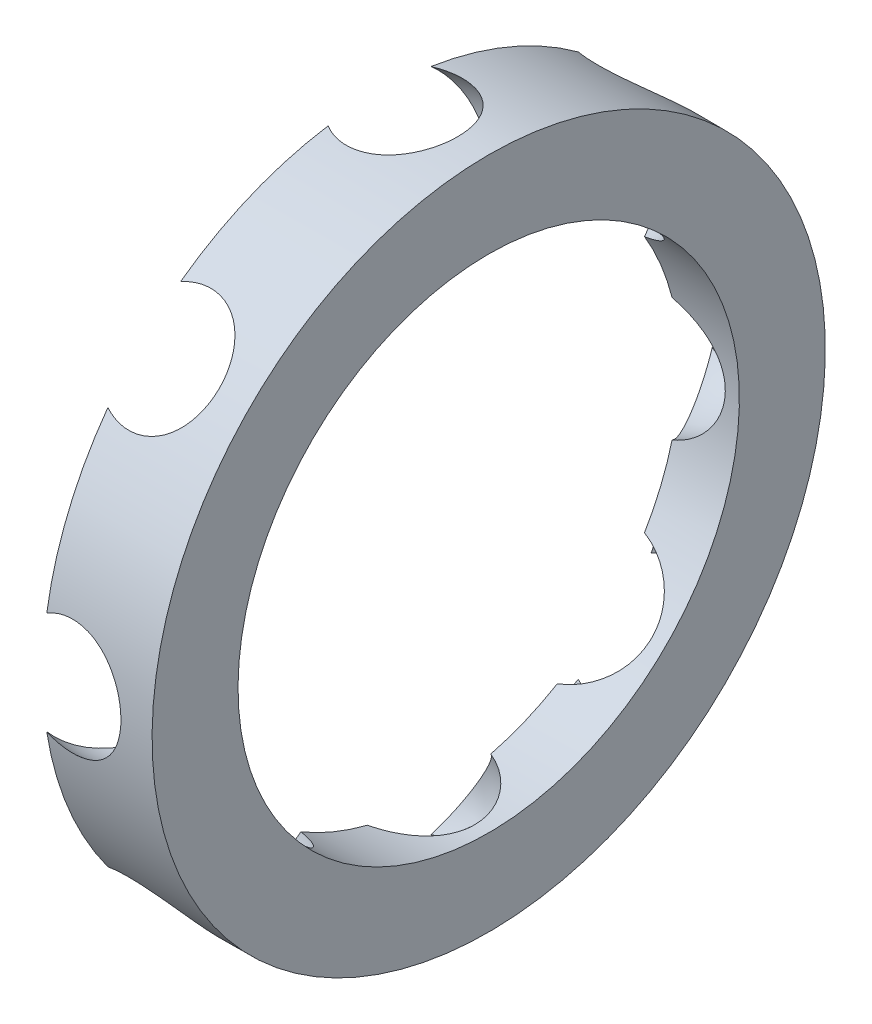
ISO-10303-21;
HEADER;
FILE_DESCRIPTION(('STEP AP214'),'2;1');
FILE_NAME('part.step','',(''),(''),'','','');
FILE_SCHEMA(('AUTOMOTIVE_DESIGN { 1 0 10303 214 1 1 1 1 }'));
ENDSEC;
DATA;
#1=APPLICATION_CONTEXT('core data for automotive mechanical design processes');
#2=APPLICATION_PROTOCOL_DEFINITION('international standard','automotive_design',2000,#1);
#3=PRODUCT_CONTEXT('',#1,'mechanical');
#4=PRODUCT('Part','Part','',(#3));
#5=PRODUCT_RELATED_PRODUCT_CATEGORY('part','',(#4));
#6=PRODUCT_DEFINITION_FORMATION('','',#4);
#7=PRODUCT_DEFINITION_CONTEXT('part definition',#1,'design');
#8=PRODUCT_DEFINITION('design','',#6,#7);
#9=PRODUCT_DEFINITION_SHAPE('','',#8);
#10=(LENGTH_UNIT() NAMED_UNIT(*) SI_UNIT(.MILLI.,.METRE.));
#11=(NAMED_UNIT(*) PLANE_ANGLE_UNIT() SI_UNIT($,.RADIAN.));
#12=(NAMED_UNIT(*) SI_UNIT($,.STERADIAN.) SOLID_ANGLE_UNIT());
#13=UNCERTAINTY_MEASURE_WITH_UNIT(LENGTH_MEASURE(1.E-05),#10,'distance_accuracy_value','');
#14=(GEOMETRIC_REPRESENTATION_CONTEXT(3) GLOBAL_UNCERTAINTY_ASSIGNED_CONTEXT((#13)) GLOBAL_UNIT_ASSIGNED_CONTEXT((#10,
#11,#12)) REPRESENTATION_CONTEXT('',''));
#15=CARTESIAN_POINT('',(0.,0.,0.));
#16=DIRECTION('',(0.,0.,1.));
#17=DIRECTION('',(1.,0.,0.));
#18=AXIS2_PLACEMENT_3D('',#15,#16,#17);
#19=DIRECTION('',(-0.499999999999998,0.86602540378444,0.));
#20=VECTOR('',#19,1.);
#21=CARTESIAN_POINT('',(5.,11.48,0.));
#22=LINE('',#21,#20);
#23=CARTESIAN_POINT('',(11.6279810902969,0.,0.));
#24=DIRECTION('',(-1.,0.,0.));
#25=AXIS1_PLACEMENT('',#23,#24);
#26=SURFACE_OF_REVOLUTION('',#22,#25);
#27=CARTESIAN_POINT('',(4.03005154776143,10.6170466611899,-7.77585494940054));
#28=CARTESIAN_POINT('',(4.05374612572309,10.625085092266,-7.69542689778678));
#29=CARTESIAN_POINT('',(4.07866675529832,10.6297767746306,-7.61502965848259));
#30=CARTESIAN_POINT('',(4.13084936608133,10.6324949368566,-7.45488801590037));
#31=CARTESIAN_POINT('',(4.15811126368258,10.6305216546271,-7.37514358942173));
#32=CARTESIAN_POINT('',(4.21485152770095,10.6199417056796,-7.21693711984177));
#33=CARTESIAN_POINT('',(4.24432864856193,10.611338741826,-7.13847438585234));
#34=CARTESIAN_POINT('',(4.3053705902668,10.5876070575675,-6.98339539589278));
#35=CARTESIAN_POINT('',(4.33693537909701,10.5724784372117,-6.90677911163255));
#36=CARTESIAN_POINT('',(4.43460116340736,10.5174541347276,-6.68046984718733));
#37=CARTESIAN_POINT('',(4.5036918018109,10.4679165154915,-6.53426536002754));
#38=CARTESIAN_POINT('',(4.64835034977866,10.3448359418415,-6.25600499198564));
#39=CARTESIAN_POINT('',(4.72391637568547,10.2712999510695,-6.1239450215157));
#40=CARTESIAN_POINT('',(4.87975504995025,10.1027882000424,-5.87820730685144));
#41=CARTESIAN_POINT('',(4.9600120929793,10.0078808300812,-5.76447286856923));
#42=CARTESIAN_POINT('',(5.12362002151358,9.79933136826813,-5.55829989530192));
#43=CARTESIAN_POINT('',(5.20697203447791,9.68568239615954,-5.46586921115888));
#44=CARTESIAN_POINT('',(5.37421186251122,9.44358050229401,-5.30544985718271));
#45=CARTESIAN_POINT('',(5.45809591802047,9.31519225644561,-5.23735941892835));
#46=CARTESIAN_POINT('',(5.62427548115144,9.04693342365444,-5.12706424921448));
#47=CARTESIAN_POINT('',(5.70657292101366,8.90707805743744,-5.08482581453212));
#48=CARTESIAN_POINT('',(5.81801062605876,8.70737088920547,-5.04472655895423));
#49=CARTESIAN_POINT('',(5.84901383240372,8.65064209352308,-5.03550328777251));
#50=CARTESIAN_POINT('',(5.91015166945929,8.53633646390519,-5.02117457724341));
#51=CARTESIAN_POINT('',(5.94028775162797,8.47876132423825,-5.01606181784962));
#52=CARTESIAN_POINT('',(5.96994845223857,8.4208018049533,-5.01299281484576));
#53=B_SPLINE_CURVE_WITH_KNOTS('',3,(#27,#28,#29,#30,#31,#32,#33,#34,#35,#36,#37,#38,#39,#40,#41,
#42,#43,#44,#45,#46,#47,#48,#49,#50,#51,#52),.UNSPECIFIED.,.F.,.F.,(4,2,2,2,2,2,2,2,2,2,2,2,4),
(0.,0.252608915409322,0.505208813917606,0.757667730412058,1.01012277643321,1.51487184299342,
2.01947457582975,2.52248492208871,3.02568034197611,3.52674655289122,4.02715812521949,
4.22295493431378,4.41840228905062),.UNSPECIFIED.);
#54=CARTESIAN_POINT('',(4.03005154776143,10.6170466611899,-7.77585494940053));
#55=VERTEX_POINT('',#54);
#56=CARTESIAN_POINT('',(5.96994845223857,8.4208018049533,-5.01299281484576));
#57=VERTEX_POINT('',#56);
#58=EDGE_CURVE('E11',#55,#57,#53,.T.);
#59=ORIENTED_EDGE('',*,*,#58,.T.);
#60=CARTESIAN_POINT('',(5.96994845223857,0.,0.));
#61=DIRECTION('',(-1.,0.,0.));
#62=DIRECTION('',(0.,1.,0.));
#63=AXIS2_PLACEMENT_3D('',#60,#61,#62);
#64=CIRCLE('',#63,9.8);
#65=CARTESIAN_POINT('',(5.96994845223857,9.49912727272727,-2.40968484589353));
#66=VERTEX_POINT('',#65);
#67=EDGE_CURVE('E383',#66,#57,#64,.T.);
#68=ORIENTED_EDGE('',*,*,#67,.F.);
#69=CARTESIAN_POINT('',(5.96994845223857,9.49912727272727,-2.40968484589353));
#70=CARTESIAN_POINT('',(5.93203788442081,9.55427466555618,-2.45930335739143));
#71=CARTESIAN_POINT('',(5.89332933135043,9.61138568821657,-2.50612562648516));
#72=CARTESIAN_POINT('',(5.81466096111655,9.72916419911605,-2.59388361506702));
#73=CARTESIAN_POINT('',(5.77470107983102,9.78983186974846,-2.63481903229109));
#74=CARTESIAN_POINT('',(5.69396430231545,9.91421529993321,-2.71042395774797));
#75=CARTESIAN_POINT('',(5.65318931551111,9.97792433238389,-2.74510655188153));
#76=CARTESIAN_POINT('',(5.57108538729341,10.1080611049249,-2.80806368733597));
#77=CARTESIAN_POINT('',(5.52975650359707,10.1744885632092,-2.83633889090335));
#78=CARTESIAN_POINT('',(5.41418739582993,10.3628801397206,-2.90595463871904));
#79=CARTESIAN_POINT('',(5.33964141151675,10.4874121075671,-2.94006713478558));
#80=CARTESIAN_POINT('',(5.19139822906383,10.7410643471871,-2.98637769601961));
#81=CARTESIAN_POINT('',(5.11770157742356,10.8701873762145,-2.99856235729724));
#82=CARTESIAN_POINT('',(4.99771325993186,11.0851040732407,-3.0003780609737));
#83=CARTESIAN_POINT('',(4.95072477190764,11.1705045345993,-2.99633144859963));
#84=CARTESIAN_POINT('',(4.85811792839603,11.3411229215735,-2.97875819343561));
#85=CARTESIAN_POINT('',(4.8124999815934,11.4263407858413,-2.96522875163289));
#86=CARTESIAN_POINT('',(4.72297982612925,11.595720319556,-2.92880315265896));
#87=CARTESIAN_POINT('',(4.6790783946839,11.6798814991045,-2.90590280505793));
#88=CARTESIAN_POINT('',(4.59331722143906,11.8462505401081,-2.85096377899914));
#89=CARTESIAN_POINT('',(4.551458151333,11.9284577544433,-2.81892211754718));
#90=CARTESIAN_POINT('',(4.44083843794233,12.1481002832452,-2.71978765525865));
#91=CARTESIAN_POINT('',(4.37431734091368,12.2828558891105,-2.64403831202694));
#92=CARTESIAN_POINT('',(4.24952394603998,12.5396599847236,-2.46865095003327));
#93=CARTESIAN_POINT('',(4.19123528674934,12.6617335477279,-2.36906140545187));
#94=CARTESIAN_POINT('',(4.11843945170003,12.8161515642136,-2.21990993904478));
#95=CARTESIAN_POINT('',(4.09991624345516,12.8556428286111,-2.17944569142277));
#96=CARTESIAN_POINT('',(4.06408037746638,12.9323840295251,-2.09605944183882));
#97=CARTESIAN_POINT('',(4.04676597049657,12.9696371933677,-2.05314116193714));
#98=CARTESIAN_POINT('',(4.03005154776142,13.0057454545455,-2.00902592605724));
#99=B_SPLINE_CURVE_WITH_KNOTS('',3,(#69,#70,#71,#72,#73,#74,#75,#76,#77,#78,#79,#80,#81,#82,#83,
#84,#85,#86,#87,#88,#89,#90,#91,#92,#93,#94,#95,#96,#97,#98),.UNSPECIFIED.,.F.,.F.,(4,2,2,2,2,2,
2,2,2,2,2,2,2,2,4),(0.,0.249850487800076,0.49971379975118,0.749047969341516,0.998356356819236,
1.44385210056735,1.88962007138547,2.18186183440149,2.47418989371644,2.766648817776,
3.05920328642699,3.56159600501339,4.06297575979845,4.24138947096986,4.41953941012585),.UNSPECIFIED.);
#100=CARTESIAN_POINT('',(4.03005154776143,13.0057454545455,-2.00902592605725));
#101=VERTEX_POINT('',#100);
#102=EDGE_CURVE('E34',#66,#101,#99,.T.);
#103=ORIENTED_EDGE('',*,*,#102,.T.);
#104=CARTESIAN_POINT('',(4.03005154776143,0.,0.));
#105=DIRECTION('',(-1.,0.,0.));
#106=DIRECTION('',(0.,1.,0.));
#107=AXIS2_PLACEMENT_3D('',#104,#105,#106);
#108=CIRCLE('',#107,13.16);
#109=EDGE_CURVE('E378',#101,#55,#108,.T.);
#110=ORIENTED_EDGE('',*,*,#109,.T.);
#111=EDGE_LOOP('',(#59,#68,#103,#110));
#112=FACE_BOUND('',#111,.T.);
#113=ADVANCED_FACE('F17',(#112),#26,.F.);
#114=CARTESIAN_POINT('',(8.3,11.48,0.));
#115=DIRECTION('',(1.,0.,0.));
#116=DIRECTION('',(0.,0.,-1.));
#117=AXIS2_PLACEMENT_3D('',#114,#115,#116);
#118=PLANE('',#117);
#119=CARTESIAN_POINT('',(8.3,0.,0.));
#120=DIRECTION('',(-1.,0.,0.));
#121=DIRECTION('',(0.,1.,0.));
#122=AXIS2_PLACEMENT_3D('',#119,#120,#121);
#123=CIRCLE('',#122,9.8);
#124=CARTESIAN_POINT('',(8.3,9.8,0.));
#125=VERTEX_POINT('',#124);
#126=EDGE_CURVE('E382',#125,#125,#123,.T.);
#127=ORIENTED_EDGE('',*,*,#126,.T.);
#128=EDGE_LOOP('',(#127));
#129=FACE_BOUND('',#128,.T.);
#130=CARTESIAN_POINT('',(8.3,0.,0.));
#131=DIRECTION('',(-1.,0.,0.));
#132=DIRECTION('',(0.,1.,0.));
#133=AXIS2_PLACEMENT_3D('',#130,#131,#132);
#134=CIRCLE('',#133,13.16);
#135=CARTESIAN_POINT('',(8.3,13.16,0.));
#136=VERTEX_POINT('',#135);
#137=EDGE_CURVE('E157',#136,#136,#134,.T.);
#138=ORIENTED_EDGE('',*,*,#137,.F.);
#139=EDGE_LOOP('',(#138));
#140=FACE_BOUND('',#139,.T.);
#141=ADVANCED_FACE('F449',(#129,#140),#118,.T.);
#142=DIRECTION('',(-0.499999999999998,0.86602540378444,0.));
#143=VECTOR('',#142,1.);
#144=CARTESIAN_POINT('',(5.,11.48,0.));
#145=LINE('',#144,#143);
#146=CARTESIAN_POINT('',(11.6279810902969,0.,0.));
#147=DIRECTION('',(-1.,0.,0.));
#148=AXIS1_PLACEMENT('',#146,#147);
#149=SURFACE_OF_REVOLUTION('',#145,#148);
#150=CARTESIAN_POINT('',(5.96994845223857,8.4208018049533,5.01299281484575));
#151=CARTESIAN_POINT('',(5.93206369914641,8.49483192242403,5.01690000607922));
#152=CARTESIAN_POINT('',(5.89338244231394,8.56827353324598,5.02416775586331));
#153=CARTESIAN_POINT('',(5.81477332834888,8.71350584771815,5.0453704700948));
#154=CARTESIAN_POINT('',(5.77484550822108,8.78529660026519,5.05930523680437));
#155=CARTESIAN_POINT('',(5.69411428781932,8.9267106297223,5.09377683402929));
#156=CARTESIAN_POINT('',(5.6533114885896,8.99633531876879,5.11430925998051));
#157=CARTESIAN_POINT('',(5.57115019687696,9.1329745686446,5.16183473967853));
#158=CARTESIAN_POINT('',(5.52979171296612,9.19998916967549,5.18882769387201));
#159=CARTESIAN_POINT('',(5.40494038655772,9.39707962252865,5.27956688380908));
#160=CARTESIAN_POINT('',(5.32100768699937,9.52261487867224,5.35293012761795));
#161=CARTESIAN_POINT('',(5.15458490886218,9.75763090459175,5.52299110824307));
#162=CARTESIAN_POINT('',(5.07209446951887,9.86711574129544,5.61968291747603));
#163=CARTESIAN_POINT('',(4.91069173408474,10.0667532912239,5.83337200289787));
#164=CARTESIAN_POINT('',(4.83177308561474,10.156941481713,5.95033128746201));
#165=CARTESIAN_POINT('',(4.67909393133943,10.3155309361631,6.20124458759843));
#166=CARTESIAN_POINT('',(4.6053355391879,10.3839233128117,6.33520550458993));
#167=CARTESIAN_POINT('',(4.46421471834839,10.4969817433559,6.61665358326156));
#168=CARTESIAN_POINT('',(4.39687991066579,10.5415488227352,6.76419423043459));
#169=CARTESIAN_POINT('',(4.27024627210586,10.6049964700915,7.06787103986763));
#170=CARTESIAN_POINT('',(4.21093765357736,10.6239085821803,7.22399640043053));
#171=CARTESIAN_POINT('',(4.13356563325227,10.6320426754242,7.44722784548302));
#172=CARTESIAN_POINT('',(4.11172628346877,10.6321759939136,7.51279533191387));
#173=CARTESIAN_POINT('',(4.06967394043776,10.6279608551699,7.64417783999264));
#174=CARTESIAN_POINT('',(4.0494581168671,10.6236203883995,7.70999221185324));
#175=CARTESIAN_POINT('',(4.03005154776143,10.6170466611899,7.77585494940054));
#176=B_SPLINE_CURVE_WITH_KNOTS('',3,(#150,#151,#152,#153,#154,#155,#156,#157,#158,#159,#160,
#161,#162,#163,#164,#165,#166,#167,#168,#169,#170,#171,#172,#173,#174,#175),.UNSPECIFIED.,.F.,
.F.,(4,2,2,2,2,2,2,2,2,2,2,2,4),(0.,0.249678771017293,0.499350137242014,0.748855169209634,
0.998356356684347,1.49940741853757,2.00033130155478,2.50032615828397,3.00052462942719,
3.50278517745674,4.0044276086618,4.21162214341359,4.41844725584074),.UNSPECIFIED.);
#177=CARTESIAN_POINT('',(5.96994845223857,8.4208018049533,5.01299281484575));
#178=VERTEX_POINT('',#177);
#179=CARTESIAN_POINT('',(4.03005154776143,10.6170466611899,7.77585494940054));
#180=VERTEX_POINT('',#179);
#181=EDGE_CURVE('E395',#178,#180,#176,.T.);
#182=ORIENTED_EDGE('',*,*,#181,.T.);
#183=CARTESIAN_POINT('',(4.03005154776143,0.,0.));
#184=DIRECTION('',(-1.,0.,0.));
#185=DIRECTION('',(0.,1.,0.));
#186=AXIS2_PLACEMENT_3D('',#183,#184,#185);
#187=CIRCLE('',#186,13.16);
#188=CARTESIAN_POINT('',(4.03005154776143,13.0057454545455,2.00902592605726));
#189=VERTEX_POINT('',#188);
#190=EDGE_CURVE('E391',#180,#189,#187,.T.);
#191=ORIENTED_EDGE('',*,*,#190,.T.);
#192=CARTESIAN_POINT('',(4.03005154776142,13.0057454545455,2.00902592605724));
#193=CARTESIAN_POINT('',(4.05372753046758,12.9545984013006,2.07153224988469));
#194=CARTESIAN_POINT('',(4.07862774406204,12.9011101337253,2.13165401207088));
#195=CARTESIAN_POINT('',(4.13076665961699,12.7898870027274,2.24673287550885));
#196=CARTESIAN_POINT('',(4.15800534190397,12.7321521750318,2.30169002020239));
#197=CARTESIAN_POINT('',(4.21473935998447,12.6128125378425,2.40609621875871));
#198=CARTESIAN_POINT('',(4.24423687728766,12.5512039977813,2.45553983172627));
#199=CARTESIAN_POINT('',(4.30532317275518,12.4246725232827,2.54849682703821));
#200=CARTESIAN_POINT('',(4.33691186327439,12.3597497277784,2.59201045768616));
#201=CARTESIAN_POINT('',(4.43466231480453,12.1606435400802,2.71323590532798));
#202=CARTESIAN_POINT('',(4.5038142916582,12.0221099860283,2.78164305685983));
#203=CARTESIAN_POINT('',(4.64851012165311,11.738261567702,2.89132250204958));
#204=CARTESIAN_POINT('',(4.72403936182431,11.5929625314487,2.93265502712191));
#205=CARTESIAN_POINT('',(4.84140255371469,11.3723562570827,2.97379630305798));
#206=CARTESIAN_POINT('',(4.88145875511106,11.297915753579,2.9840310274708));
#207=CARTESIAN_POINT('',(4.96262204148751,11.1489023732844,2.99727675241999));
#208=CARTESIAN_POINT('',(5.00372957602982,11.0743294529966,3.00028460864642));
#209=CARTESIAN_POINT('',(5.09270447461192,10.9149591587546,2.99894338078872));
#210=CARTESIAN_POINT('',(5.14069230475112,10.8302370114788,2.99347164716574));
#211=CARTESIAN_POINT('',(5.23730237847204,10.6622407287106,2.97306345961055));
#212=CARTESIAN_POINT('',(5.28592500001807,10.5789675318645,2.95812108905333));
#213=CARTESIAN_POINT('',(5.38340365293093,10.4146240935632,2.91887996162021));
#214=CARTESIAN_POINT('',(5.43225991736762,10.3335571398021,2.89456798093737));
#215=CARTESIAN_POINT('',(5.52965390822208,10.1745372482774,2.83683145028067));
#216=CARTESIAN_POINT('',(5.57819158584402,10.0965847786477,2.80340553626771));
#217=CARTESIAN_POINT('',(5.68563729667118,9.92683707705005,2.71894739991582));
#218=CARTESIAN_POINT('',(5.74433719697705,9.83602891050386,2.66562936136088));
#219=CARTESIAN_POINT('',(5.83053880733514,9.70534078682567,2.57636673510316));
#220=CARTESIAN_POINT('',(5.85892207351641,9.66276050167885,2.54512050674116));
#221=CARTESIAN_POINT('',(5.91498839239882,9.57949615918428,2.4796275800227));
#222=CARTESIAN_POINT('',(5.94267150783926,9.53881193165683,2.44538115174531));
#223=CARTESIAN_POINT('',(5.96994845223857,9.49912727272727,2.40968484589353));
#224=B_SPLINE_CURVE_WITH_KNOTS('',3,(#192,#193,#194,#195,#196,#197,#198,#199,#200,#201,#202,
#203,#204,#205,#206,#207,#208,#209,#210,#211,#212,#213,#214,#215,#216,#217,#218,#219,#220,#221,
#222,#223),.UNSPECIFIED.,.F.,.F.,(4,2,2,2,2,2,2,2,2,2,2,2,2,2,2,4),(0.,0.252411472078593,
0.504820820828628,0.757477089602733,1.01012277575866,1.51536259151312,2.01947457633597,
2.27466158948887,2.52995961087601,2.82204784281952,3.11431873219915,3.40700363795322,
3.69973237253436,4.06041181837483,4.240195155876,4.41996232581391),.UNSPECIFIED.);
#225=CARTESIAN_POINT('',(5.96994845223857,9.49912727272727,2.40968484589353));
#226=VERTEX_POINT('',#225);
#227=EDGE_CURVE('E396',#189,#226,#224,.T.);
#228=ORIENTED_EDGE('',*,*,#227,.T.);
#229=CARTESIAN_POINT('',(5.96994845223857,0.,0.));
#230=DIRECTION('',(-1.,0.,0.));
#231=DIRECTION('',(0.,1.,0.));
#232=AXIS2_PLACEMENT_3D('',#229,#230,#231);
#233=CIRCLE('',#232,9.8);
#234=EDGE_CURVE('E360',#178,#226,#233,.T.);
#235=ORIENTED_EDGE('',*,*,#234,.F.);
#236=EDGE_LOOP('',(#182,#191,#228,#235));
#237=FACE_BOUND('',#236,.T.);
#238=ADVANCED_FACE('F456',(#237),#149,.F.);
#239=DIRECTION('',(-0.499999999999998,0.86602540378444,0.));
#240=VECTOR('',#239,1.);
#241=CARTESIAN_POINT('',(5.,11.48,0.));
#242=LINE('',#241,#240);
#243=CARTESIAN_POINT('',(11.6279810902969,0.,0.));
#244=DIRECTION('',(-1.,0.,0.));
#245=AXIS1_PLACEMENT('',#243,#244);
#246=SURFACE_OF_REVOLUTION('',#242,#245);
#247=CARTESIAN_POINT('',(4.03005154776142,2.00902592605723,-13.0057454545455));
#248=CARTESIAN_POINT('',(4.05374612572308,2.071581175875,-12.9545582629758));
#249=CARTESIAN_POINT('',(4.07866675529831,2.13174812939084,-12.9010263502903));
#250=CARTESIAN_POINT('',(4.13084936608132,2.24690740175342,-12.7897111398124));
#251=CARTESIAN_POINT('',(4.15811126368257,2.30189990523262,-12.7319279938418));
#252=CARTESIAN_POINT('',(4.21485152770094,2.40628761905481,-12.6125779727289));
#253=CARTESIAN_POINT('',(4.24432864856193,2.45568593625,-12.5510132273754));
#254=CARTESIAN_POINT('',(4.30537059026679,2.54856250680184,-12.4245749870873));
#255=CARTESIAN_POINT('',(4.336935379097,2.59204085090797,-12.359701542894));
#256=CARTESIAN_POINT('',(4.43460116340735,2.71315760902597,-12.1607686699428));
#257=CARTESIAN_POINT('',(4.50369180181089,2.78151140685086,-12.0223580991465));
#258=CARTESIAN_POINT('',(4.64835034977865,2.89124009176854,-11.7385671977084));
#259=CARTESIAN_POINT('',(4.72391637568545,2.93262279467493,-11.5931888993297));
#260=CARTESIAN_POINT('',(4.87975504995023,2.98722979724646,-11.3002702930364));
#261=CARTESIAN_POINT('',(4.96001209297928,3.00054254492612,-11.1527382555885));
#262=CARTESIAN_POINT('',(5.12362002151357,2.99886211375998,-10.8594852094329));
#263=CARTESIAN_POINT('',(5.20697203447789,2.98385851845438,-10.7137648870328));
#264=CARTESIAN_POINT('',(5.3742118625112,2.92610024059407,-10.4291393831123));
#265=CARTESIAN_POINT('',(5.45809591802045,2.88346325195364,-10.2902079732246));
#266=CARTESIAN_POINT('',(5.62427548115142,2.77176607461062,-10.022529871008));
#267=CARTESIAN_POINT('',(5.70657292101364,2.70274048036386,-9.89377010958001));
#268=CARTESIAN_POINT('',(5.81801062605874,2.58988064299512,-9.72420136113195));
#269=CARTESIAN_POINT('',(5.84901383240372,2.55628916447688,-9.67756620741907));
#270=CARTESIAN_POINT('',(5.91015166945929,2.48559480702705,-9.58660799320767));
#271=CARTESIAN_POINT('',(5.94028775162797,2.44849830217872,-9.54228095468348));
#272=CARTESIAN_POINT('',(5.96994845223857,2.40968484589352,-9.49912727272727));
#273=B_SPLINE_CURVE_WITH_KNOTS('',3,(#247,#248,#249,#250,#251,#252,#253,#254,#255,#256,#257,
#258,#259,#260,#261,#262,#263,#264,#265,#266,#267,#268,#269,#270,#271,#272),.UNSPECIFIED.,.F.,
.F.,(4,2,2,2,2,2,2,2,2,2,2,2,4),(0.,0.252608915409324,0.505208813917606,0.757667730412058,
1.0101227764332,1.51487184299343,2.01947457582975,2.52248492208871,3.02568034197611,
3.52674655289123,4.02715812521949,4.22295493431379,4.41840228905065),.UNSPECIFIED.);
#274=CARTESIAN_POINT('',(4.03005154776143,2.00902592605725,-13.0057454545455));
#275=VERTEX_POINT('',#274);
#276=CARTESIAN_POINT('',(5.96994845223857,2.40968484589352,-9.49912727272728));
#277=VERTEX_POINT('',#276);
#278=EDGE_CURVE('E242',#275,#277,#273,.T.);
#279=ORIENTED_EDGE('',*,*,#278,.T.);
#280=CARTESIAN_POINT('',(5.96994845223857,0.,0.));
#281=DIRECTION('',(-1.,0.,0.));
#282=DIRECTION('',(0.,1.,0.));
#283=AXIS2_PLACEMENT_3D('',#280,#281,#282);
#284=CIRCLE('',#283,9.8);
#285=CARTESIAN_POINT('',(5.96994845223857,5.01299281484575,-8.42080180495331));
#286=VERTEX_POINT('',#285);
#287=EDGE_CURVE('E402',#286,#277,#284,.T.);
#288=ORIENTED_EDGE('',*,*,#287,.F.);
#289=CARTESIAN_POINT('',(5.96994845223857,5.01299281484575,-8.42080180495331));
#290=CARTESIAN_POINT('',(5.93206369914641,5.01690000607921,-8.49483192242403));
#291=CARTESIAN_POINT('',(5.89338244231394,5.02416775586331,-8.56827353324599));
#292=CARTESIAN_POINT('',(5.81477332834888,5.0453704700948,-8.71350584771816));
#293=CARTESIAN_POINT('',(5.77484550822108,5.05930523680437,-8.7852966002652));
#294=CARTESIAN_POINT('',(5.69411428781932,5.09377683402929,-8.92671062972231));
#295=CARTESIAN_POINT('',(5.65331148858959,5.11430925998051,-8.9963353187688));
#296=CARTESIAN_POINT('',(5.57115019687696,5.16183473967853,-9.13297456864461));
#297=CARTESIAN_POINT('',(5.52979171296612,5.18882769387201,-9.1999891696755));
#298=CARTESIAN_POINT('',(5.40494038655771,5.27956688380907,-9.39707962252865));
#299=CARTESIAN_POINT('',(5.32100768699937,5.35293012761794,-9.52261487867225));
#300=CARTESIAN_POINT('',(5.15458490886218,5.52299110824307,-9.75763090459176));
#301=CARTESIAN_POINT('',(5.07209446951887,5.61968291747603,-9.86711574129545));
#302=CARTESIAN_POINT('',(4.91069173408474,5.83337200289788,-10.0667532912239));
#303=CARTESIAN_POINT('',(4.83177308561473,5.950331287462,-10.156941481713));
#304=CARTESIAN_POINT('',(4.67909393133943,6.20124458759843,-10.3155309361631));
#305=CARTESIAN_POINT('',(4.60533553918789,6.33520550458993,-10.3839233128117));
#306=CARTESIAN_POINT('',(4.46421471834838,6.61665358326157,-10.4969817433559));
#307=CARTESIAN_POINT('',(4.39687991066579,6.76419423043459,-10.5415488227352));
#308=CARTESIAN_POINT('',(4.27024627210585,7.06787103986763,-10.6049964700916));
#309=CARTESIAN_POINT('',(4.21093765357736,7.22399640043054,-10.6239085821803));
#310=CARTESIAN_POINT('',(4.13356563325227,7.44722784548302,-10.6320426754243));
#311=CARTESIAN_POINT('',(4.11172628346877,7.51279533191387,-10.6321759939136));
#312=CARTESIAN_POINT('',(4.06967394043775,7.64417783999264,-10.6279608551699));
#313=CARTESIAN_POINT('',(4.0494581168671,7.70999221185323,-10.6236203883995));
#314=CARTESIAN_POINT('',(4.03005154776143,7.77585494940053,-10.6170466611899));
#315=B_SPLINE_CURVE_WITH_KNOTS('',3,(#289,#290,#291,#292,#293,#294,#295,#296,#297,#298,#299,
#300,#301,#302,#303,#304,#305,#306,#307,#308,#309,#310,#311,#312,#313,#314),.UNSPECIFIED.,.F.,
.F.,(4,2,2,2,2,2,2,2,2,2,2,2,4),(0.,0.249678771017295,0.499350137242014,0.748855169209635,
0.998356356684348,1.49940741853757,2.00033130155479,2.50032615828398,3.0005246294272,
3.50278517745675,4.00442760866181,4.21162214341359,4.41844725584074),.UNSPECIFIED.);
#316=CARTESIAN_POINT('',(4.03005154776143,7.77585494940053,-10.6170466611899));
#317=VERTEX_POINT('',#316);
#318=EDGE_CURVE('E401',#286,#317,#315,.T.);
#319=ORIENTED_EDGE('',*,*,#318,.T.);
#320=CARTESIAN_POINT('',(4.03005154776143,0.,0.));
#321=DIRECTION('',(-1.,0.,0.));
#322=DIRECTION('',(0.,1.,0.));
#323=AXIS2_PLACEMENT_3D('',#320,#321,#322);
#324=CIRCLE('',#323,13.16);
#325=EDGE_CURVE('E397',#317,#275,#324,.T.);
#326=ORIENTED_EDGE('',*,*,#325,.T.);
#327=EDGE_LOOP('',(#279,#288,#319,#326));
#328=FACE_BOUND('',#327,.T.);
#329=ADVANCED_FACE('F272',(#328),#246,.F.);
#330=DIRECTION('',(-0.499999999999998,0.86602540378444,0.));
#331=VECTOR('',#330,1.);
#332=CARTESIAN_POINT('',(5.,11.48,0.));
#333=LINE('',#332,#331);
#334=CARTESIAN_POINT('',(11.6279810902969,0.,0.));
#335=DIRECTION('',(-1.,0.,0.));
#336=AXIS1_PLACEMENT('',#334,#335);
#337=SURFACE_OF_REVOLUTION('',#333,#336);
#338=CARTESIAN_POINT('',(4.03005154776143,-7.77585494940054,-10.6170466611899));
#339=CARTESIAN_POINT('',(4.05374612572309,-7.69542689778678,-10.625085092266));
#340=CARTESIAN_POINT('',(4.07866675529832,-7.61502965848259,-10.6297767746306));
#341=CARTESIAN_POINT('',(4.13084936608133,-7.45488801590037,-10.6324949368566));
#342=CARTESIAN_POINT('',(4.15811126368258,-7.37514358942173,-10.6305216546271));
#343=CARTESIAN_POINT('',(4.21485152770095,-7.21693711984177,-10.6199417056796));
#344=CARTESIAN_POINT('',(4.24432864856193,-7.13847438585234,-10.611338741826));
#345=CARTESIAN_POINT('',(4.3053705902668,-6.98339539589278,-10.5876070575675));
#346=CARTESIAN_POINT('',(4.33693537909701,-6.90677911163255,-10.5724784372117));
#347=CARTESIAN_POINT('',(4.43460116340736,-6.68046984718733,-10.5174541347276));
#348=CARTESIAN_POINT('',(4.5036918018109,-6.53426536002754,-10.4679165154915));
#349=CARTESIAN_POINT('',(4.64835034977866,-6.25600499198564,-10.3448359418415));
#350=CARTESIAN_POINT('',(4.72391637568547,-6.1239450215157,-10.2712999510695));
#351=CARTESIAN_POINT('',(4.87975504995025,-5.87820730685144,-10.1027882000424));
#352=CARTESIAN_POINT('',(4.9600120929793,-5.76447286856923,-10.0078808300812));
#353=CARTESIAN_POINT('',(5.12362002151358,-5.55829989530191,-9.79933136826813));
#354=CARTESIAN_POINT('',(5.20697203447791,-5.46586921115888,-9.68568239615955));
#355=CARTESIAN_POINT('',(5.37421186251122,-5.30544985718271,-9.44358050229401));
#356=CARTESIAN_POINT('',(5.45809591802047,-5.23735941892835,-9.31519225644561));
#357=CARTESIAN_POINT('',(5.62427548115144,-5.12706424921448,-9.04693342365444));
#358=CARTESIAN_POINT('',(5.70657292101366,-5.08482581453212,-8.90707805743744));
#359=CARTESIAN_POINT('',(5.81801062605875,-5.04472655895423,-8.70737088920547));
#360=CARTESIAN_POINT('',(5.84901383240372,-5.03550328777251,-8.65064209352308));
#361=CARTESIAN_POINT('',(5.91015166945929,-5.02117457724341,-8.53633646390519));
#362=CARTESIAN_POINT('',(5.94028775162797,-5.01606181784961,-8.47876132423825));
#363=CARTESIAN_POINT('',(5.96994845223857,-5.01299281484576,-8.4208018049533));
#364=B_SPLINE_CURVE_WITH_KNOTS('',3,(#338,#339,#340,#341,#342,#343,#344,#345,#346,#347,#348,
#349,#350,#351,#352,#353,#354,#355,#356,#357,#358,#359,#360,#361,#362,#363),.UNSPECIFIED.,.F.,
.F.,(4,2,2,2,2,2,2,2,2,2,2,2,4),(0.,0.252608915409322,0.505208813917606,0.757667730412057,
1.0101227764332,1.51487184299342,2.01947457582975,2.52248492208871,3.02568034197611,
3.52674655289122,4.02715812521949,4.22295493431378,4.41840228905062),.UNSPECIFIED.);
#365=CARTESIAN_POINT('',(4.03005154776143,-7.77585494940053,-10.6170466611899));
#366=VERTEX_POINT('',#365);
#367=CARTESIAN_POINT('',(5.96994845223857,-5.01299281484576,-8.4208018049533));
#368=VERTEX_POINT('',#367);
#369=EDGE_CURVE('E259',#366,#368,#364,.T.);
#370=ORIENTED_EDGE('',*,*,#369,.T.);
#371=CARTESIAN_POINT('',(5.96994845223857,0.,0.));
#372=DIRECTION('',(-1.,0.,0.));
#373=DIRECTION('',(0.,1.,0.));
#374=AXIS2_PLACEMENT_3D('',#371,#372,#373);
#375=CIRCLE('',#374,9.8);
#376=CARTESIAN_POINT('',(5.96994845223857,-2.40968484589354,-9.49912727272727));
#377=VERTEX_POINT('',#376);
#378=EDGE_CURVE('E409',#377,#368,#375,.T.);
#379=ORIENTED_EDGE('',*,*,#378,.F.);
#380=CARTESIAN_POINT('',(5.96994845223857,-2.40968484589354,-9.49912727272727));
#381=CARTESIAN_POINT('',(5.93206369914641,-2.45926924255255,-9.55423727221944));
#382=CARTESIAN_POINT('',(5.89338244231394,-2.50606122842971,-9.6113074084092));
#383=CARTESIAN_POINT('',(5.81477332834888,-2.59376339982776,-9.72899474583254));
#384=CARTESIAN_POINT('',(5.77484550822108,-2.63467375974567,-9.78961184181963));
#385=CARTESIAN_POINT('',(5.69411428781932,-2.71029347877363,-9.91398176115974));
#386=CARTESIAN_POINT('',(5.65331148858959,-2.74500695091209,-9.97773246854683));
#387=CARTESIAN_POINT('',(5.57115019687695,-2.8080199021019,-10.1079565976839));
#388=CARTESIAN_POINT('',(5.52979171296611,-2.83631947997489,-10.1744299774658));
#389=CARTESIAN_POINT('',(5.40494038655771,-2.91152117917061,-10.3779562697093));
#390=CARTESIAN_POINT('',(5.32100768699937,-2.94841236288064,-10.5185987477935));
#391=CARTESIAN_POINT('',(5.15458490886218,-2.99434251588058,-10.8050314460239));
#392=CARTESIAN_POINT('',(5.07209446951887,-3.00338855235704,-10.950820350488));
#393=CARTESIAN_POINT('',(4.91069173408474,-2.99345261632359,-11.2430864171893));
#394=CARTESIAN_POINT('',(4.83177308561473,-2.97452259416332,-11.389561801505));
#395=CARTESIAN_POINT('',(4.67909393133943,-2.90923977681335,-11.6791239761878));
#396=CARTESIAN_POINT('',(4.60533553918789,-2.86287581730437,-11.8222093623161));
#397=CARTESIAN_POINT('',(4.46421471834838,-2.74380635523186,-12.1011675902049));
#398=CARTESIAN_POINT('',(4.39687991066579,-2.67099304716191,-12.2370082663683));
#399=CARTESIAN_POINT('',(4.27024627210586,-2.50112537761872,-12.4966044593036));
#400=CARTESIAN_POINT('',(4.21093765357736,-2.40410095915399,-12.6203746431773));
#401=CARTESIAN_POINT('',(4.13356563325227,-2.25200416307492,-12.7839747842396));
#402=CARTESIAN_POINT('',(4.11172628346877,-2.20573521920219,-12.8304322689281));
#403=CARTESIAN_POINT('',(4.06967394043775,-2.10985320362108,-12.9203531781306));
#404=CARTESIAN_POINT('',(4.0494581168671,-2.06024624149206,-12.9638217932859));
#405=CARTESIAN_POINT('',(4.03005154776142,-2.00902592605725,-13.0057454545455));
#406=B_SPLINE_CURVE_WITH_KNOTS('',3,(#380,#381,#382,#383,#384,#385,#386,#387,#388,#389,#390,
#391,#392,#393,#394,#395,#396,#397,#398,#399,#400,#401,#402,#403,#404,#405),.UNSPECIFIED.,.F.,
.F.,(4,2,2,2,2,2,2,2,2,2,2,2,4),(0.,0.249678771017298,0.499350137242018,0.748855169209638,
0.99835635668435,1.49940741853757,2.00033130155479,2.50032615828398,3.0005246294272,
3.50278517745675,4.00442760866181,4.2116221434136,4.41844725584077),.UNSPECIFIED.);
#407=CARTESIAN_POINT('',(4.03005154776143,-2.00902592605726,-13.0057454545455));
#408=VERTEX_POINT('',#407);
#409=EDGE_CURVE('E250',#377,#408,#406,.T.);
#410=ORIENTED_EDGE('',*,*,#409,.T.);
#411=CARTESIAN_POINT('',(4.03005154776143,0.,0.));
#412=DIRECTION('',(-1.,0.,0.));
#413=DIRECTION('',(0.,1.,0.));
#414=AXIS2_PLACEMENT_3D('',#411,#412,#413);
#415=CIRCLE('',#414,13.16);
#416=EDGE_CURVE('E260',#408,#366,#415,.T.);
#417=ORIENTED_EDGE('',*,*,#416,.T.);
#418=EDGE_LOOP('',(#370,#379,#410,#417));
#419=FACE_BOUND('',#418,.T.);
#420=ADVANCED_FACE('F267',(#419),#337,.F.);
#421=DIRECTION('',(-0.499999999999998,0.86602540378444,0.));
#422=VECTOR('',#421,1.);
#423=CARTESIAN_POINT('',(5.,11.48,0.));
#424=LINE('',#423,#422);
#425=CARTESIAN_POINT('',(11.6279810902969,0.,0.));
#426=DIRECTION('',(-1.,0.,0.));
#427=AXIS1_PLACEMENT('',#425,#426);
#428=SURFACE_OF_REVOLUTION('',#424,#427);
#429=CARTESIAN_POINT('',(4.03005154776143,0.,0.));
#430=DIRECTION('',(-1.,0.,0.));
#431=DIRECTION('',(0.,1.,0.));
#432=AXIS2_PLACEMENT_3D('',#429,#430,#431);
#433=CIRCLE('',#432,13.16);
#434=CARTESIAN_POINT('',(4.03005154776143,-10.6170466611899,-7.77585494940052));
#435=VERTEX_POINT('',#434);
#436=CARTESIAN_POINT('',(4.03005154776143,-13.0057454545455,-2.00902592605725));
#437=VERTEX_POINT('',#436);
#438=EDGE_CURVE('E178',#435,#437,#433,.T.);
#439=ORIENTED_EDGE('',*,*,#438,.T.);
#440=CARTESIAN_POINT('',(4.03005154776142,-13.0057454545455,-2.00902592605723));
#441=CARTESIAN_POINT('',(4.05372753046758,-12.9545984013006,-2.07153224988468));
#442=CARTESIAN_POINT('',(4.07862774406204,-12.9011101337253,-2.13165401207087));
#443=CARTESIAN_POINT('',(4.13076665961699,-12.7898870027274,-2.24673287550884));
#444=CARTESIAN_POINT('',(4.15800534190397,-12.7321521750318,-2.30169002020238));
#445=CARTESIAN_POINT('',(4.21473935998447,-12.6128125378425,-2.40609621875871));
#446=CARTESIAN_POINT('',(4.24423687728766,-12.5512039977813,-2.45553983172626));
#447=CARTESIAN_POINT('',(4.30532317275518,-12.4246725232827,-2.5484968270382));
#448=CARTESIAN_POINT('',(4.33691186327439,-12.3597497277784,-2.59201045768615));
#449=CARTESIAN_POINT('',(4.43466231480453,-12.1606435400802,-2.71323590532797));
#450=CARTESIAN_POINT('',(4.5038142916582,-12.0221099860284,-2.78164305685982));
#451=CARTESIAN_POINT('',(4.6485101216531,-11.738261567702,-2.89132250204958));
#452=CARTESIAN_POINT('',(4.7240393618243,-11.5929625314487,-2.9326550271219));
#453=CARTESIAN_POINT('',(4.84140255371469,-11.3723562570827,-2.97379630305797));
#454=CARTESIAN_POINT('',(4.88145875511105,-11.297915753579,-2.98403102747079));
#455=CARTESIAN_POINT('',(4.96262204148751,-11.1489023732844,-2.99727675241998));
#456=CARTESIAN_POINT('',(5.00372957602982,-11.0743294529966,-3.00028460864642));
#457=CARTESIAN_POINT('',(5.09270447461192,-10.9149591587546,-2.99894338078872));
#458=CARTESIAN_POINT('',(5.14069230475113,-10.8302370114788,-2.99347164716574));
#459=CARTESIAN_POINT('',(5.23730237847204,-10.6622407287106,-2.97306345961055));
#460=CARTESIAN_POINT('',(5.28592500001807,-10.5789675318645,-2.95812108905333));
#461=CARTESIAN_POINT('',(5.38340365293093,-10.4146240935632,-2.91887996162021));
#462=CARTESIAN_POINT('',(5.43225991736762,-10.3335571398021,-2.89456798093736));
#463=CARTESIAN_POINT('',(5.52965390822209,-10.1745372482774,-2.83683145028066));
#464=CARTESIAN_POINT('',(5.57819158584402,-10.0965847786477,-2.8034055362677));
#465=CARTESIAN_POINT('',(5.68563729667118,-9.92683707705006,-2.71894739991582));
#466=CARTESIAN_POINT('',(5.74433719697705,-9.83602891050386,-2.66562936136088));
#467=CARTESIAN_POINT('',(5.83053880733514,-9.70534078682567,-2.57636673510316));
#468=CARTESIAN_POINT('',(5.8589220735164,-9.66276050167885,-2.54512050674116));
#469=CARTESIAN_POINT('',(5.91498839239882,-9.57949615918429,-2.47962758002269));
#470=CARTESIAN_POINT('',(5.94267150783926,-9.53881193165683,-2.44538115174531));
#471=CARTESIAN_POINT('',(5.96994845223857,-9.49912727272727,-2.40968484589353));
#472=B_SPLINE_CURVE_WITH_KNOTS('',3,(#440,#441,#442,#443,#444,#445,#446,#447,#448,#449,#450,
#451,#452,#453,#454,#455,#456,#457,#458,#459,#460,#461,#462,#463,#464,#465,#466,#467,#468,#469,
#470,#471),.UNSPECIFIED.,.F.,.F.,(4,2,2,2,2,2,2,2,2,2,2,2,2,2,2,4),(0.,0.252411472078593,
0.504820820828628,0.757477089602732,1.01012277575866,1.51536259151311,2.01947457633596,
2.27466158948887,2.52995961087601,2.82204784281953,3.11431873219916,3.40700363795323,
3.69973237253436,4.06041181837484,4.24019515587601,4.41996232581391),.UNSPECIFIED.);
#473=CARTESIAN_POINT('',(5.96994845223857,-9.49912727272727,-2.40968484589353));
#474=VERTEX_POINT('',#473);
#475=EDGE_CURVE('E152',#437,#474,#472,.T.);
#476=ORIENTED_EDGE('',*,*,#475,.T.);
#477=CARTESIAN_POINT('',(5.96994845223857,0.,0.));
#478=DIRECTION('',(-1.,0.,0.));
#479=DIRECTION('',(0.,1.,0.));
#480=AXIS2_PLACEMENT_3D('',#477,#478,#479);
#481=CIRCLE('',#480,9.8);
#482=CARTESIAN_POINT('',(5.96994845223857,-8.42080180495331,-5.01299281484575));
#483=VERTEX_POINT('',#482);
#484=EDGE_CURVE('E417',#483,#474,#481,.T.);
#485=ORIENTED_EDGE('',*,*,#484,.F.);
#486=CARTESIAN_POINT('',(5.96994845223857,-8.42080180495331,-5.01299281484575));
#487=CARTESIAN_POINT('',(5.93206369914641,-8.49483192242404,-5.01690000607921));
#488=CARTESIAN_POINT('',(5.89338244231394,-8.56827353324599,-5.02416775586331));
#489=CARTESIAN_POINT('',(5.81477332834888,-8.71350584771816,-5.0453704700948));
#490=CARTESIAN_POINT('',(5.77484550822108,-8.7852966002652,-5.05930523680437));
#491=CARTESIAN_POINT('',(5.69411428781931,-8.92671062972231,-5.09377683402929));
#492=CARTESIAN_POINT('',(5.65331148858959,-8.9963353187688,-5.11430925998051));
#493=CARTESIAN_POINT('',(5.57115019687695,-9.13297456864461,-5.16183473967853));
#494=CARTESIAN_POINT('',(5.52979171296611,-9.1999891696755,-5.18882769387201));
#495=CARTESIAN_POINT('',(5.40494038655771,-9.39707962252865,-5.27956688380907));
#496=CARTESIAN_POINT('',(5.32100768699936,-9.52261487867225,-5.35293012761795));
#497=CARTESIAN_POINT('',(5.15458490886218,-9.75763090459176,-5.52299110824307));
#498=CARTESIAN_POINT('',(5.07209446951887,-9.86711574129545,-5.61968291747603));
#499=CARTESIAN_POINT('',(4.91069173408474,-10.0667532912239,-5.83337200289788));
#500=CARTESIAN_POINT('',(4.83177308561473,-10.156941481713,-5.95033128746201));
#501=CARTESIAN_POINT('',(4.67909393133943,-10.3155309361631,-6.20124458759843));
#502=CARTESIAN_POINT('',(4.60533553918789,-10.3839233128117,-6.33520550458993));
#503=CARTESIAN_POINT('',(4.46421471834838,-10.4969817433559,-6.61665358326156));
#504=CARTESIAN_POINT('',(4.39687991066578,-10.5415488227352,-6.76419423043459));
#505=CARTESIAN_POINT('',(4.27024627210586,-10.6049964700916,-7.06787103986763));
#506=CARTESIAN_POINT('',(4.21093765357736,-10.6239085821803,-7.22399640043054));
#507=CARTESIAN_POINT('',(4.13356563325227,-10.6320426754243,-7.44722784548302));
#508=CARTESIAN_POINT('',(4.11172628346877,-10.6321759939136,-7.51279533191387));
#509=CARTESIAN_POINT('',(4.06967394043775,-10.6279608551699,-7.64417783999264));
#510=CARTESIAN_POINT('',(4.0494581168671,-10.6236203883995,-7.70999221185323));
#511=CARTESIAN_POINT('',(4.03005154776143,-10.6170466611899,-7.77585494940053));
#512=B_SPLINE_CURVE_WITH_KNOTS('',3,(#486,#487,#488,#489,#490,#491,#492,#493,#494,#495,#496,
#497,#498,#499,#500,#501,#502,#503,#504,#505,#506,#507,#508,#509,#510,#511),.UNSPECIFIED.,.F.,
.F.,(4,2,2,2,2,2,2,2,2,2,2,2,4),(0.,0.249678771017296,0.499350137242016,0.748855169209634,
0.998356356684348,1.49940741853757,2.00033130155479,2.50032615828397,3.0005246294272,
3.50278517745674,4.00442760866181,4.21162214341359,4.41844725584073),.UNSPECIFIED.);
#513=EDGE_CURVE('E416',#483,#435,#512,.T.);
#514=ORIENTED_EDGE('',*,*,#513,.T.);
#515=EDGE_LOOP('',(#439,#476,#485,#514));
#516=FACE_BOUND('',#515,.T.);
#517=ADVANCED_FACE('F271',(#516),#428,.F.);
#518=DIRECTION('',(-0.499999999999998,0.86602540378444,0.));
#519=VECTOR('',#518,1.);
#520=CARTESIAN_POINT('',(5.,11.48,0.));
#521=LINE('',#520,#519);
#522=CARTESIAN_POINT('',(11.6279810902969,0.,0.));
#523=DIRECTION('',(-1.,0.,0.));
#524=AXIS1_PLACEMENT('',#522,#523);
#525=SURFACE_OF_REVOLUTION('',#521,#524);
#526=CARTESIAN_POINT('',(4.03005154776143,-10.6170466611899,7.77585494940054));
#527=CARTESIAN_POINT('',(4.05374612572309,-10.625085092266,7.69542689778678));
#528=CARTESIAN_POINT('',(4.07866675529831,-10.6297767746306,7.61502965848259));
#529=CARTESIAN_POINT('',(4.13084936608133,-10.6324949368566,7.45488801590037));
#530=CARTESIAN_POINT('',(4.15811126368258,-10.6305216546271,7.37514358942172));
#531=CARTESIAN_POINT('',(4.21485152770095,-10.6199417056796,7.21693711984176));
#532=CARTESIAN_POINT('',(4.24432864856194,-10.611338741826,7.13847438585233));
#533=CARTESIAN_POINT('',(4.3053705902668,-10.5876070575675,6.98339539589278));
#534=CARTESIAN_POINT('',(4.33693537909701,-10.5724784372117,6.90677911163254));
#535=CARTESIAN_POINT('',(4.43460116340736,-10.5174541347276,6.68046984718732));
#536=CARTESIAN_POINT('',(4.5036918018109,-10.4679165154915,6.53426536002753));
#537=CARTESIAN_POINT('',(4.64835034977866,-10.3448359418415,6.25600499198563));
#538=CARTESIAN_POINT('',(4.72391637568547,-10.2712999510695,6.1239450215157));
#539=CARTESIAN_POINT('',(4.87975504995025,-10.1027882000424,5.87820730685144));
#540=CARTESIAN_POINT('',(4.9600120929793,-10.0078808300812,5.76447286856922));
#541=CARTESIAN_POINT('',(5.12362002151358,-9.79933136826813,5.55829989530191));
#542=CARTESIAN_POINT('',(5.20697203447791,-9.68568239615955,5.46586921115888));
#543=CARTESIAN_POINT('',(5.37421186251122,-9.44358050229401,5.3054498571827));
#544=CARTESIAN_POINT('',(5.45809591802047,-9.31519225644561,5.23735941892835));
#545=CARTESIAN_POINT('',(5.62427548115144,-9.04693342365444,5.12706424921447));
#546=CARTESIAN_POINT('',(5.70657292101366,-8.90707805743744,5.08482581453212));
#547=CARTESIAN_POINT('',(5.81801062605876,-8.70737088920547,5.04472655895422));
#548=CARTESIAN_POINT('',(5.84901383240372,-8.65064209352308,5.0355032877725));
#549=CARTESIAN_POINT('',(5.9101516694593,-8.53633646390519,5.0211745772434));
#550=CARTESIAN_POINT('',(5.94028775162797,-8.47876132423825,5.0160618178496));
#551=CARTESIAN_POINT('',(5.96994845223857,-8.4208018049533,5.01299281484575));
#552=B_SPLINE_CURVE_WITH_KNOTS('',3,(#526,#527,#528,#529,#530,#531,#532,#533,#534,#535,#536,
#537,#538,#539,#540,#541,#542,#543,#544,#545,#546,#547,#548,#549,#550,#551),.UNSPECIFIED.,.F.,
.F.,(4,2,2,2,2,2,2,2,2,2,2,2,4),(0.,0.252608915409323,0.505208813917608,0.757667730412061,
1.01012277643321,1.51487184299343,2.01947457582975,2.52248492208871,3.02568034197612,
3.52674655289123,4.02715812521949,4.22295493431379,4.41840228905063),.UNSPECIFIED.);
#553=CARTESIAN_POINT('',(4.03005154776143,-10.6170466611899,7.77585494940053));
#554=VERTEX_POINT('',#553);
#555=CARTESIAN_POINT('',(5.96994845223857,-8.4208018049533,5.01299281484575));
#556=VERTEX_POINT('',#555);
#557=EDGE_CURVE('E171',#554,#556,#552,.T.);
#558=ORIENTED_EDGE('',*,*,#557,.T.);
#559=CARTESIAN_POINT('',(5.96994845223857,0.,0.));
#560=DIRECTION('',(-1.,0.,0.));
#561=DIRECTION('',(0.,1.,0.));
#562=AXIS2_PLACEMENT_3D('',#559,#560,#561);
#563=CIRCLE('',#562,9.8);
#564=CARTESIAN_POINT('',(5.96994845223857,-9.49912727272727,2.40968484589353));
#565=VERTEX_POINT('',#564);
#566=EDGE_CURVE('E169',#565,#556,#563,.T.);
#567=ORIENTED_EDGE('',*,*,#566,.F.);
#568=CARTESIAN_POINT('',(5.96994845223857,-9.49912727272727,2.40968484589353));
#569=CARTESIAN_POINT('',(5.93203788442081,-9.55427466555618,2.45930335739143));
#570=CARTESIAN_POINT('',(5.89332933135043,-9.61138568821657,2.50612562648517));
#571=CARTESIAN_POINT('',(5.81466096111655,-9.72916419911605,2.59388361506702));
#572=CARTESIAN_POINT('',(5.77470107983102,-9.78983186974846,2.63481903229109));
#573=CARTESIAN_POINT('',(5.69396430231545,-9.91421529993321,2.71042395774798));
#574=CARTESIAN_POINT('',(5.65318931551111,-9.97792433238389,2.74510655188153));
#575=CARTESIAN_POINT('',(5.57108538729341,-10.1080611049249,2.80806368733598));
#576=CARTESIAN_POINT('',(5.52975650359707,-10.1744885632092,2.83633889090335));
#577=CARTESIAN_POINT('',(5.41418739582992,-10.3628801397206,2.90595463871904));
#578=CARTESIAN_POINT('',(5.33964141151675,-10.4874121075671,2.94006713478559));
#579=CARTESIAN_POINT('',(5.19139822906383,-10.7410643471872,2.98637769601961));
#580=CARTESIAN_POINT('',(5.11770157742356,-10.8701873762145,2.99856235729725));
#581=CARTESIAN_POINT('',(4.99771325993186,-11.0851040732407,3.00037806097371));
#582=CARTESIAN_POINT('',(4.95072477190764,-11.1705045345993,2.99633144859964));
#583=CARTESIAN_POINT('',(4.85811792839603,-11.3411229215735,2.97875819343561));
#584=CARTESIAN_POINT('',(4.81249998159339,-11.4263407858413,2.9652287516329));
#585=CARTESIAN_POINT('',(4.72297982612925,-11.595720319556,2.92880315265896));
#586=CARTESIAN_POINT('',(4.6790783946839,-11.6798814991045,2.90590280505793));
#587=CARTESIAN_POINT('',(4.59331722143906,-11.8462505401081,2.85096377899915));
#588=CARTESIAN_POINT('',(4.551458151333,-11.9284577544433,2.81892211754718));
#589=CARTESIAN_POINT('',(4.44083843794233,-12.1481002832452,2.71978765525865));
#590=CARTESIAN_POINT('',(4.37431734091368,-12.2828558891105,2.64403831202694));
#591=CARTESIAN_POINT('',(4.24952394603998,-12.5396599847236,2.46865095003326));
#592=CARTESIAN_POINT('',(4.19123528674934,-12.6617335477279,2.36906140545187));
#593=CARTESIAN_POINT('',(4.11843945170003,-12.8161515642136,2.21990993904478));
#594=CARTESIAN_POINT('',(4.09991624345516,-12.8556428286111,2.17944569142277));
#595=CARTESIAN_POINT('',(4.06408037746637,-12.9323840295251,2.09605944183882));
#596=CARTESIAN_POINT('',(4.04676597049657,-12.9696371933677,2.05314116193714));
#597=CARTESIAN_POINT('',(4.03005154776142,-13.0057454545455,2.00902592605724));
#598=B_SPLINE_CURVE_WITH_KNOTS('',3,(#568,#569,#570,#571,#572,#573,#574,#575,#576,#577,#578,
#579,#580,#581,#582,#583,#584,#585,#586,#587,#588,#589,#590,#591,#592,#593,#594,#595,#596,#597),
.UNSPECIFIED.,.F.,.F.,(4,2,2,2,2,2,2,2,2,2,2,2,2,2,4),(0.,0.249850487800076,0.499713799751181,
0.749047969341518,0.998356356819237,1.44385210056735,1.88962007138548,2.18186183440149,
2.47418989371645,2.76664881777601,3.059203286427,3.5615960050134,4.06297575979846,
4.24138947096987,4.41953941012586),.UNSPECIFIED.);
#599=CARTESIAN_POINT('',(4.03005154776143,-13.0057454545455,2.00902592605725));
#600=VERTEX_POINT('',#599);
#601=EDGE_CURVE('E149',#565,#600,#598,.T.);
#602=ORIENTED_EDGE('',*,*,#601,.T.);
#603=CARTESIAN_POINT('',(4.03005154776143,0.,0.));
#604=DIRECTION('',(-1.,0.,0.));
#605=DIRECTION('',(0.,1.,0.));
#606=AXIS2_PLACEMENT_3D('',#603,#604,#605);
#607=CIRCLE('',#606,13.16);
#608=EDGE_CURVE('E141',#600,#554,#607,.T.);
#609=ORIENTED_EDGE('',*,*,#608,.T.);
#610=EDGE_LOOP('',(#558,#567,#602,#609));
#611=FACE_BOUND('',#610,.T.);
#612=ADVANCED_FACE('F167',(#611),#525,.F.);
#613=DIRECTION('',(-0.499999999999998,0.86602540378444,0.));
#614=VECTOR('',#613,1.);
#615=CARTESIAN_POINT('',(5.,11.48,0.));
#616=LINE('',#615,#614);
#617=CARTESIAN_POINT('',(11.6279810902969,0.,0.));
#618=DIRECTION('',(-1.,0.,0.));
#619=AXIS1_PLACEMENT('',#617,#618);
#620=SURFACE_OF_REVOLUTION('',#616,#619);
#621=CARTESIAN_POINT('',(4.03005154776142,-2.00902592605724,13.0057454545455));
#622=CARTESIAN_POINT('',(4.05374612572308,-2.07158117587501,12.9545582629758));
#623=CARTESIAN_POINT('',(4.07866675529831,-2.13174812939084,12.9010263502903));
#624=CARTESIAN_POINT('',(4.13084936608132,-2.24690740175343,12.7897111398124));
#625=CARTESIAN_POINT('',(4.15811126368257,-2.30189990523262,12.7319279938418));
#626=CARTESIAN_POINT('',(4.21485152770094,-2.40628761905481,12.6125779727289));
#627=CARTESIAN_POINT('',(4.24432864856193,-2.45568593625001,12.5510132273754));
#628=CARTESIAN_POINT('',(4.30537059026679,-2.54856250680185,12.4245749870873));
#629=CARTESIAN_POINT('',(4.33693537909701,-2.59204085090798,12.359701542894));
#630=CARTESIAN_POINT('',(4.43460116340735,-2.71315760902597,12.1607686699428));
#631=CARTESIAN_POINT('',(4.50369180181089,-2.78151140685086,12.0223580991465));
#632=CARTESIAN_POINT('',(4.64835034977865,-2.89124009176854,11.7385671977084));
#633=CARTESIAN_POINT('',(4.72391637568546,-2.93262279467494,11.5931888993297));
#634=CARTESIAN_POINT('',(4.87975504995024,-2.98722979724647,11.3002702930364));
#635=CARTESIAN_POINT('',(4.96001209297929,-3.00054254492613,11.1527382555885));
#636=CARTESIAN_POINT('',(5.12362002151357,-2.99886211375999,10.8594852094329));
#637=CARTESIAN_POINT('',(5.2069720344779,-2.98385851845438,10.7137648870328));
#638=CARTESIAN_POINT('',(5.37421186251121,-2.92610024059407,10.4291393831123));
#639=CARTESIAN_POINT('',(5.45809591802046,-2.88346325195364,10.2902079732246));
#640=CARTESIAN_POINT('',(5.62427548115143,-2.77176607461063,10.022529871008));
#641=CARTESIAN_POINT('',(5.70657292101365,-2.70274048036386,9.89377010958));
#642=CARTESIAN_POINT('',(5.81801062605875,-2.58988064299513,9.72420136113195));
#643=CARTESIAN_POINT('',(5.84901383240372,-2.55628916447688,9.67756620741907));
#644=CARTESIAN_POINT('',(5.91015166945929,-2.48559480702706,9.58660799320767));
#645=CARTESIAN_POINT('',(5.94028775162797,-2.44849830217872,9.54228095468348));
#646=CARTESIAN_POINT('',(5.96994845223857,-2.40968484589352,9.49912727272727));
#647=B_SPLINE_CURVE_WITH_KNOTS('',3,(#621,#622,#623,#624,#625,#626,#627,#628,#629,#630,#631,
#632,#633,#634,#635,#636,#637,#638,#639,#640,#641,#642,#643,#644,#645,#646),.UNSPECIFIED.,.F.,
.F.,(4,2,2,2,2,2,2,2,2,2,2,2,4),(0.,0.252608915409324,0.505208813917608,0.757667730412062,
1.01012277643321,1.51487184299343,2.01947457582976,2.52248492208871,3.02568034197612,
3.52674655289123,4.02715812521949,4.2229549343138,4.41840228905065),.UNSPECIFIED.);
#648=CARTESIAN_POINT('',(4.03005154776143,-2.00902592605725,13.0057454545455));
#649=VERTEX_POINT('',#648);
#650=CARTESIAN_POINT('',(5.96994845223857,-2.40968484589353,9.49912727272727));
#651=VERTEX_POINT('',#650);
#652=EDGE_CURVE('E165',#649,#651,#647,.T.);
#653=ORIENTED_EDGE('',*,*,#652,.T.);
#654=CARTESIAN_POINT('',(5.96994845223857,0.,0.));
#655=DIRECTION('',(-1.,0.,0.));
#656=DIRECTION('',(0.,1.,0.));
#657=AXIS2_PLACEMENT_3D('',#654,#655,#656);
#658=CIRCLE('',#657,9.8);
#659=CARTESIAN_POINT('',(5.96994845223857,-5.01299281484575,8.42080180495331));
#660=VERTEX_POINT('',#659);
#661=EDGE_CURVE('E348',#660,#651,#658,.T.);
#662=ORIENTED_EDGE('',*,*,#661,.F.);
#663=CARTESIAN_POINT('',(5.96994845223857,-5.01299281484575,8.42080180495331));
#664=CARTESIAN_POINT('',(5.9320636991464,-5.01690000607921,8.49483192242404));
#665=CARTESIAN_POINT('',(5.89338244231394,-5.02416775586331,8.56827353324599));
#666=CARTESIAN_POINT('',(5.81477332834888,-5.0453704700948,8.71350584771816));
#667=CARTESIAN_POINT('',(5.77484550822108,-5.05930523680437,8.7852966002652));
#668=CARTESIAN_POINT('',(5.69411428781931,-5.0937768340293,8.92671062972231));
#669=CARTESIAN_POINT('',(5.65331148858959,-5.11430925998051,8.9963353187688));
#670=CARTESIAN_POINT('',(5.57115019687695,-5.16183473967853,9.13297456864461));
#671=CARTESIAN_POINT('',(5.52979171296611,-5.18882769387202,9.1999891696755));
#672=CARTESIAN_POINT('',(5.40494038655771,-5.27956688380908,9.39707962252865));
#673=CARTESIAN_POINT('',(5.32100768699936,-5.35293012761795,9.52261487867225));
#674=CARTESIAN_POINT('',(5.15458490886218,-5.52299110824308,9.75763090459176));
#675=CARTESIAN_POINT('',(5.07209446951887,-5.61968291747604,9.86711574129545));
#676=CARTESIAN_POINT('',(4.91069173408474,-5.83337200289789,10.0667532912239));
#677=CARTESIAN_POINT('',(4.83177308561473,-5.95033128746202,10.156941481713));
#678=CARTESIAN_POINT('',(4.67909393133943,-6.20124458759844,10.3155309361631));
#679=CARTESIAN_POINT('',(4.60533553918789,-6.33520550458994,10.3839233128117));
#680=CARTESIAN_POINT('',(4.46421471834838,-6.61665358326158,10.4969817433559));
#681=CARTESIAN_POINT('',(4.39687991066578,-6.7641942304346,10.5415488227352));
#682=CARTESIAN_POINT('',(4.27024627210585,-7.06787103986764,10.6049964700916));
#683=CARTESIAN_POINT('',(4.21093765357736,-7.22399640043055,10.6239085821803));
#684=CARTESIAN_POINT('',(4.13356563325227,-7.44722784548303,10.6320426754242));
#685=CARTESIAN_POINT('',(4.11172628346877,-7.51279533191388,10.6321759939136));
#686=CARTESIAN_POINT('',(4.06967394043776,-7.64417783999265,10.6279608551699));
#687=CARTESIAN_POINT('',(4.0494581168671,-7.70999221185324,10.6236203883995));
#688=CARTESIAN_POINT('',(4.03005154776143,-7.77585494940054,10.6170466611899));
#689=B_SPLINE_CURVE_WITH_KNOTS('',3,(#663,#664,#665,#666,#667,#668,#669,#670,#671,#672,#673,
#674,#675,#676,#677,#678,#679,#680,#681,#682,#683,#684,#685,#686,#687,#688),.UNSPECIFIED.,.F.,
.F.,(4,2,2,2,2,2,2,2,2,2,2,2,4),(0.,0.249678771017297,0.499350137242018,0.748855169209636,
0.998356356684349,1.49940741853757,2.00033130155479,2.50032615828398,3.0005246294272,
3.50278517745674,4.00442760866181,4.21162214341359,4.41844725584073),.UNSPECIFIED.);
#690=CARTESIAN_POINT('',(4.03005154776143,-7.77585494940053,10.6170466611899));
#691=VERTEX_POINT('',#690);
#692=EDGE_CURVE('E299',#660,#691,#689,.T.);
#693=ORIENTED_EDGE('',*,*,#692,.T.);
#694=CARTESIAN_POINT('',(4.03005154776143,0.,0.));
#695=DIRECTION('',(-1.,0.,0.));
#696=DIRECTION('',(0.,1.,0.));
#697=AXIS2_PLACEMENT_3D('',#694,#695,#696);
#698=CIRCLE('',#697,13.16);
#699=EDGE_CURVE('E306',#691,#649,#698,.T.);
#700=ORIENTED_EDGE('',*,*,#699,.T.);
#701=EDGE_LOOP('',(#653,#662,#693,#700));
#702=FACE_BOUND('',#701,.T.);
#703=ADVANCED_FACE('F290',(#702),#620,.F.);
#704=DIRECTION('',(-0.499999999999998,0.86602540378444,0.));
#705=VECTOR('',#704,1.);
#706=CARTESIAN_POINT('',(5.,11.48,0.));
#707=LINE('',#706,#705);
#708=CARTESIAN_POINT('',(11.6279810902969,0.,0.));
#709=DIRECTION('',(-1.,0.,0.));
#710=AXIS1_PLACEMENT('',#708,#709);
#711=SURFACE_OF_REVOLUTION('',#707,#710);
#712=CARTESIAN_POINT('',(4.03005154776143,7.77585494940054,10.6170466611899));
#713=CARTESIAN_POINT('',(4.05374612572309,7.69542689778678,10.625085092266));
#714=CARTESIAN_POINT('',(4.07866675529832,7.61502965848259,10.6297767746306));
#715=CARTESIAN_POINT('',(4.13084936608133,7.45488801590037,10.6324949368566));
#716=CARTESIAN_POINT('',(4.15811126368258,7.37514358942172,10.6305216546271));
#717=CARTESIAN_POINT('',(4.21485152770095,7.21693711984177,10.6199417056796));
#718=CARTESIAN_POINT('',(4.24432864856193,7.13847438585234,10.611338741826));
#719=CARTESIAN_POINT('',(4.3053705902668,6.98339539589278,10.5876070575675));
#720=CARTESIAN_POINT('',(4.33693537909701,6.90677911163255,10.5724784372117));
#721=CARTESIAN_POINT('',(4.43460116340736,6.68046984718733,10.5174541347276));
#722=CARTESIAN_POINT('',(4.5036918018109,6.53426536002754,10.4679165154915));
#723=CARTESIAN_POINT('',(4.64835034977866,6.25600499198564,10.3448359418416));
#724=CARTESIAN_POINT('',(4.72391637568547,6.12394502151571,10.2712999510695));
#725=CARTESIAN_POINT('',(4.87975504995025,5.87820730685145,10.1027882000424));
#726=CARTESIAN_POINT('',(4.96001209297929,5.76447286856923,10.0078808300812));
#727=CARTESIAN_POINT('',(5.12362002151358,5.55829989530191,9.79933136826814));
#728=CARTESIAN_POINT('',(5.20697203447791,5.46586921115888,9.68568239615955));
#729=CARTESIAN_POINT('',(5.37421186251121,5.30544985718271,9.44358050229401));
#730=CARTESIAN_POINT('',(5.45809591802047,5.23735941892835,9.31519225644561));
#731=CARTESIAN_POINT('',(5.62427548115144,5.12706424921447,9.04693342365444));
#732=CARTESIAN_POINT('',(5.70657292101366,5.08482581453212,8.90707805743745));
#733=CARTESIAN_POINT('',(5.81801062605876,5.04472655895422,8.70737088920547));
#734=CARTESIAN_POINT('',(5.84901383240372,5.0355032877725,8.65064209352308));
#735=CARTESIAN_POINT('',(5.91015166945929,5.0211745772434,8.5363364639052));
#736=CARTESIAN_POINT('',(5.94028775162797,5.01606181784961,8.47876132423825));
#737=CARTESIAN_POINT('',(5.96994845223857,5.01299281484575,8.4208018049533));
#738=B_SPLINE_CURVE_WITH_KNOTS('',3,(#712,#713,#714,#715,#716,#717,#718,#719,#720,#721,#722,
#723,#724,#725,#726,#727,#728,#729,#730,#731,#732,#733,#734,#735,#736,#737),.UNSPECIFIED.,.F.,
.F.,(4,2,2,2,2,2,2,2,2,2,2,2,4),(0.,0.252608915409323,0.505208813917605,0.757667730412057,
1.0101227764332,1.51487184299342,2.01947457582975,2.5224849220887,3.02568034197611,
3.52674655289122,4.02715812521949,4.22295493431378,4.41840228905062),.UNSPECIFIED.);
#739=CARTESIAN_POINT('',(4.03005154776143,7.77585494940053,10.6170466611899));
#740=VERTEX_POINT('',#739);
#741=CARTESIAN_POINT('',(5.96994845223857,5.01299281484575,8.4208018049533));
#742=VERTEX_POINT('',#741);
#743=EDGE_CURVE('E307',#740,#742,#738,.T.);
#744=ORIENTED_EDGE('',*,*,#743,.T.);
#745=CARTESIAN_POINT('',(5.96994845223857,0.,0.));
#746=DIRECTION('',(-1.,0.,0.));
#747=DIRECTION('',(0.,1.,0.));
#748=AXIS2_PLACEMENT_3D('',#745,#746,#747);
#749=CIRCLE('',#748,9.8);
#750=CARTESIAN_POINT('',(5.96994845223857,2.40968484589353,9.49912727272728));
#751=VERTEX_POINT('',#750);
#752=EDGE_CURVE('E349',#751,#742,#749,.T.);
#753=ORIENTED_EDGE('',*,*,#752,.F.);
#754=CARTESIAN_POINT('',(5.96994845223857,2.40968484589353,9.49912727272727));
#755=CARTESIAN_POINT('',(5.93206369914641,2.45926924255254,9.55423727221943));
#756=CARTESIAN_POINT('',(5.89338244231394,2.50606122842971,9.6113074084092));
#757=CARTESIAN_POINT('',(5.81477332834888,2.59376339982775,9.72899474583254));
#758=CARTESIAN_POINT('',(5.77484550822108,2.63467375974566,9.78961184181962));
#759=CARTESIAN_POINT('',(5.69411428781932,2.71029347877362,9.91398176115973));
#760=CARTESIAN_POINT('',(5.6533114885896,2.74500695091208,9.97773246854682));
#761=CARTESIAN_POINT('',(5.57115019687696,2.8080199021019,10.1079565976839));
#762=CARTESIAN_POINT('',(5.52979171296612,2.83631947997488,10.1744299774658));
#763=CARTESIAN_POINT('',(5.40494038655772,2.9115211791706,10.3779562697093));
#764=CARTESIAN_POINT('',(5.32100768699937,2.94841236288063,10.5185987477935));
#765=CARTESIAN_POINT('',(5.15458490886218,2.99434251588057,10.8050314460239));
#766=CARTESIAN_POINT('',(5.07209446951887,3.00338855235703,10.950820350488));
#767=CARTESIAN_POINT('',(4.91069173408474,2.99345261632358,11.2430864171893));
#768=CARTESIAN_POINT('',(4.83177308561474,2.97452259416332,11.389561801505));
#769=CARTESIAN_POINT('',(4.67909393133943,2.90923977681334,11.6791239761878));
#770=CARTESIAN_POINT('',(4.6053355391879,2.86287581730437,11.8222093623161));
#771=CARTESIAN_POINT('',(4.46421471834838,2.74380635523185,12.1011675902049));
#772=CARTESIAN_POINT('',(4.39687991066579,2.6709930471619,12.2370082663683));
#773=CARTESIAN_POINT('',(4.27024627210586,2.50112537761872,12.4966044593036));
#774=CARTESIAN_POINT('',(4.21093765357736,2.40410095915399,12.6203746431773));
#775=CARTESIAN_POINT('',(4.13356563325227,2.25200416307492,12.7839747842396));
#776=CARTESIAN_POINT('',(4.11172628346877,2.20573521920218,12.8304322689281));
#777=CARTESIAN_POINT('',(4.06967394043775,2.10985320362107,12.9203531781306));
#778=CARTESIAN_POINT('',(4.0494581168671,2.06024624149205,12.9638217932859));
#779=CARTESIAN_POINT('',(4.03005154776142,2.00902592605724,13.0057454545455));
#780=B_SPLINE_CURVE_WITH_KNOTS('',3,(#754,#755,#756,#757,#758,#759,#760,#761,#762,#763,#764,
#765,#766,#767,#768,#769,#770,#771,#772,#773,#774,#775,#776,#777,#778,#779),.UNSPECIFIED.,.F.,
.F.,(4,2,2,2,2,2,2,2,2,2,2,2,4),(0.,0.249678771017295,0.499350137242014,0.748855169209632,
0.998356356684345,1.49940741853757,2.00033130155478,2.50032615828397,3.0005246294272,
3.50278517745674,4.00442760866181,4.21162214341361,4.41844725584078),.UNSPECIFIED.);
#781=CARTESIAN_POINT('',(4.03005154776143,2.00902592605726,13.0057454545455));
#782=VERTEX_POINT('',#781);
#783=EDGE_CURVE('E314',#751,#782,#780,.T.);
#784=ORIENTED_EDGE('',*,*,#783,.T.);
#785=CARTESIAN_POINT('',(4.03005154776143,0.,0.));
#786=DIRECTION('',(-1.,0.,0.));
#787=DIRECTION('',(0.,1.,0.));
#788=AXIS2_PLACEMENT_3D('',#785,#786,#787);
#789=CIRCLE('',#788,13.16);
#790=EDGE_CURVE('E430',#782,#740,#789,.T.);
#791=ORIENTED_EDGE('',*,*,#790,.T.);
#792=EDGE_LOOP('',(#744,#753,#784,#791));
#793=FACE_BOUND('',#792,.T.);
#794=ADVANCED_FACE('F294',(#793),#711,.F.);
#795=CARTESIAN_POINT('',(5.,7.77817459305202,7.77817459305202));
#796=DIRECTION('',(0.916946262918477,0.388862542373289,0.089417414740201));
#797=DIRECTION('',(-0.366053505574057,0.908996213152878,-0.199325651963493));
#798=AXIS2_PLACEMENT_3D('',#795,#796,#797);
#799=SPHERICAL_SURFACE('',#798,3.);
#800=CARTESIAN_POINT('',(7.75083878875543,8.94476222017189,8.04642683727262));
#801=VERTEX_POINT('',#800);
#802=VERTEX_LOOP('',#801);
#803=FACE_BOUND('',#802,.T.);
#804=CARTESIAN_POINT('',(4.03005154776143,10.6170466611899,7.77585494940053));
#805=CARTESIAN_POINT('',(4.07705836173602,10.6330928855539,7.7539438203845));
#806=CARTESIAN_POINT('',(4.12516568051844,10.6479520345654,7.73351477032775));
#807=CARTESIAN_POINT('',(4.2232906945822,10.6752223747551,7.69582847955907));
#808=CARTESIAN_POINT('',(4.27330879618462,10.6876330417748,7.67857191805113));
#809=CARTESIAN_POINT('',(4.37495269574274,10.7099275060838,7.64744526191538));
#810=CARTESIAN_POINT('',(4.42657875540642,10.7198108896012,7.63357572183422));
#811=CARTESIAN_POINT('',(4.53106135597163,10.7369859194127,7.60939874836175));
#812=CARTESIAN_POINT('',(4.5839177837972,10.7442778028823,7.59909098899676));
#813=CARTESIAN_POINT('',(4.74399628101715,10.7622076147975,7.57370138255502));
#814=CARTESIAN_POINT('',(4.85263646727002,10.7688797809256,7.56418129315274));
#815=CARTESIAN_POINT('',(5.07016608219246,10.771427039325,7.56055282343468));
#816=CARTESIAN_POINT('',(5.17905526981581,10.7673100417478,7.56643315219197));
#817=CARTESIAN_POINT('',(5.39213005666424,10.7485871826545,7.59300506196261));
#818=CARTESIAN_POINT('',(5.49636464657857,10.7341664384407,7.61343521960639));
#819=CARTESIAN_POINT('',(5.69933267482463,10.6953950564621,7.66780472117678));
#820=CARTESIAN_POINT('',(5.79806387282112,10.6710404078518,7.70174952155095));
#821=CARTESIAN_POINT('',(5.98981549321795,10.6122884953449,7.78251060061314));
#822=CARTESIAN_POINT('',(6.08264883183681,10.57767009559,7.82960881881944));
#823=CARTESIAN_POINT('',(6.25799958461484,10.4993944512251,7.93426602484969));
#824=CARTESIAN_POINT('',(6.34051557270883,10.4557359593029,7.99182645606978));
#825=CARTESIAN_POINT('',(6.49898856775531,10.3569726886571,8.11946104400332));
#826=CARTESIAN_POINT('',(6.57411216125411,10.3012896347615,8.19012150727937));
#827=CARTESIAN_POINT('',(6.70963812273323,10.181730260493,8.33828724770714));
#828=CARTESIAN_POINT('',(6.77003477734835,10.1178507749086,8.41579516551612));
#829=CARTESIAN_POINT('',(6.87953716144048,9.97765764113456,8.58164609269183));
#830=CARTESIAN_POINT('',(6.92733216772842,9.90075594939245,8.67035822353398));
#831=CARTESIAN_POINT('',(7.00411037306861,9.74047539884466,8.85004220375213));
#832=CARTESIAN_POINT('',(7.03308757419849,9.65709448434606,8.94101476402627));
#833=CARTESIAN_POINT('',(7.07309979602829,9.48033444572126,9.12833142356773));
#834=CARTESIAN_POINT('',(7.08290565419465,9.38665603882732,9.22465738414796));
#835=CARTESIAN_POINT('',(7.08078262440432,9.1964882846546,9.41425747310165));
#836=CARTESIAN_POINT('',(7.06885069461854,9.09999854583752,9.50753117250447));
#837=CARTESIAN_POINT('',(7.02285980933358,8.90471252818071,9.69071844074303));
#838=CARTESIAN_POINT('',(6.98829485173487,8.80591457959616,9.78050417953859));
#839=CARTESIAN_POINT('',(6.8969815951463,8.61153513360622,9.95207916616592));
#840=CARTESIAN_POINT('',(6.84022348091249,8.51595507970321,10.033864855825));
#841=CARTESIAN_POINT('',(6.7070125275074,8.33394346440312,10.1855150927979));
#842=CARTESIAN_POINT('',(6.63103896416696,8.24735284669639,10.2556091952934));
#843=CARTESIAN_POINT('',(6.46038075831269,8.08490350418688,10.3841534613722));
#844=CARTESIAN_POINT('',(6.36574527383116,8.00901746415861,10.4426334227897));
#845=CARTESIAN_POINT('',(6.21798580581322,7.91041330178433,10.5172428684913));
#846=CARTESIAN_POINT('',(6.1713614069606,7.88175276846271,10.5387247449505));
#847=CARTESIAN_POINT('',(6.07523260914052,7.82754750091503,10.5790470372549));
#848=CARTESIAN_POINT('',(6.02572786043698,7.80200314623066,10.5978871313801));
#849=CARTESIAN_POINT('',(5.88110055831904,7.73418650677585,10.6475794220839));
#850=CARTESIAN_POINT('',(5.78281760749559,7.69604553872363,10.6751092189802));
#851=CARTESIAN_POINT('',(5.57972903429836,7.63329604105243,10.7200698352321));
#852=CARTESIAN_POINT('',(5.47491681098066,7.60870146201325,10.7374902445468));
#853=CARTESIAN_POINT('',(5.26157678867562,7.57432077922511,10.7617710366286));
#854=CARTESIAN_POINT('',(5.15304578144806,7.56454780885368,10.7686220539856));
#855=CARTESIAN_POINT('',(4.93552597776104,7.56038978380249,10.7715418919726));
#856=CARTESIAN_POINT('',(4.82653712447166,7.56600669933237,10.7676093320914));
#857=CARTESIAN_POINT('',(4.61318431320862,7.59208921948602,10.7492335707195));
#858=CARTESIAN_POINT('',(4.50877324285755,7.61230098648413,10.7349700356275));
#859=CARTESIAN_POINT('',(4.30559156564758,7.66625554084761,10.6965047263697));
#860=CARTESIAN_POINT('',(4.20681131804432,7.69997435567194,10.672320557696));
#861=CARTESIAN_POINT('',(4.08436703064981,7.75119415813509,10.6350733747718));
#862=CARTESIAN_POINT('',(4.05702112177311,7.76328243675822,10.6262540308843));
#863=CARTESIAN_POINT('',(4.0300515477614,7.77585494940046,10.6170466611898));
#864=B_SPLINE_CURVE_WITH_KNOTS('',3,(#804,#805,#806,#807,#808,#809,#810,#811,#812,#813,#814,
#815,#816,#817,#818,#819,#820,#821,#822,#823,#824,#825,#826,#827,#828,#829,#830,#831,#832,#833,
#834,#835,#836,#837,#838,#839,#840,#841,#842,#843,#844,#845,#846,#847,#848,#849,#850,#851,#852,
#853,#854,#855,#856,#857,#858,#859,#860,#861,#862,#863),.UNSPECIFIED.,.F.,.F.,(4,2,2,2,2,2,2,2,
2,2,2,2,2,2,2,2,2,2,2,2,2,2,2,2,2,2,2,2,2,4),(0.,0.162825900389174,0.325686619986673,
0.488573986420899,0.651446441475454,0.97747978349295,1.30327415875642,1.62335789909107,
1.94357100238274,2.27125818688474,2.5989906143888,2.94911648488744,3.29937797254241,
3.67800890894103,4.05676046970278,4.45908884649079,4.861473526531,5.2731763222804,
5.68506140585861,6.08754199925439,6.48897623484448,6.66518251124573,6.84141022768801,
7.16673086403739,7.49238590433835,7.81832933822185,8.14431450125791,8.46476254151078,
8.7846443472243,8.87812186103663),.UNSPECIFIED.);
#865=EDGE_CURVE('E563',#180,#740,#864,.T.);
#866=ORIENTED_EDGE('',*,*,#865,.F.);
#867=ORIENTED_EDGE('',*,*,#181,.F.);
#868=CARTESIAN_POINT('',(5.96994845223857,5.01299281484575,8.42080180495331));
#869=CARTESIAN_POINT('',(6.0422011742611,5.03525661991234,8.40754336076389));
#870=CARTESIAN_POINT('',(6.11337569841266,5.0599737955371,8.39271413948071));
#871=CARTESIAN_POINT('',(6.25315456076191,5.11412218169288,8.35983107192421));
#872=CARTESIAN_POINT('',(6.32175842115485,5.14355426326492,8.34177662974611));
#873=CARTESIAN_POINT('',(6.52318794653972,5.23868343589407,8.28261953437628));
#874=CARTESIAN_POINT('',(6.65148500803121,5.3111680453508,8.23654935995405));
#875=CARTESIAN_POINT('',(6.8919921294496,5.47170520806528,8.13078531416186));
#876=CARTESIAN_POINT('',(7.00417464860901,5.55978385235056,8.07106856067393));
#877=CARTESIAN_POINT('',(7.20836554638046,5.74809446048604,7.93805034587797));
#878=CARTESIAN_POINT('',(7.30039501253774,5.84831354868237,7.864763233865));
#879=CARTESIAN_POINT('',(7.45781416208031,6.05301147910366,7.70824191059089));
#880=CARTESIAN_POINT('',(7.52408572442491,6.15718224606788,7.62549345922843));
#881=CARTESIAN_POINT('',(7.63219809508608,6.36917095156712,7.44933574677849));
#882=CARTESIAN_POINT('',(7.67404444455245,6.47698805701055,7.35592890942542));
#883=CARTESIAN_POINT('',(7.72964198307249,6.68506261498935,7.16717369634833));
#884=CARTESIAN_POINT('',(7.74504581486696,6.78535498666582,7.07234819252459));
#885=CARTESIAN_POINT('',(7.75234033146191,6.98225723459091,6.87802290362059));
#886=CARTESIAN_POINT('',(7.74422800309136,7.0788666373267,6.77852252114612));
#887=CARTESIAN_POINT('',(7.70544743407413,7.26258867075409,6.58121834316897));
#888=CARTESIAN_POINT('',(7.67549807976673,7.34990463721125,6.48345989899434));
#889=CARTESIAN_POINT('',(7.59496856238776,7.51634915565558,6.28973462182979));
#890=CARTESIAN_POINT('',(7.54442733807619,7.59549280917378,6.19376476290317));
#891=CARTESIAN_POINT('',(7.4695062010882,7.68851384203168,6.07681354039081));
#892=CARTESIAN_POINT('',(7.4538923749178,7.70686821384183,6.05351501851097));
#893=CARTESIAN_POINT('',(7.42151995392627,7.74297351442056,6.00726400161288));
#894=CARTESIAN_POINT('',(7.40476174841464,7.76072464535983,5.98431139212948));
#895=CARTESIAN_POINT('',(7.30966540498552,7.85650331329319,5.85934335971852));
#896=CARTESIAN_POINT('',(7.22046155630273,7.92876348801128,5.76086364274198));
#897=CARTESIAN_POINT('',(7.02227848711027,8.06048892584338,5.57508837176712));
#898=CARTESIAN_POINT('',(6.91321751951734,8.11989898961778,5.48784169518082));
#899=CARTESIAN_POINT('',(6.73466614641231,8.2005636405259,5.36593884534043));
#900=CARTESIAN_POINT('',(6.67085317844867,8.22657565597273,5.32592425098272));
#901=CARTESIAN_POINT('',(6.53931989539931,8.27502231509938,5.2503352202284));
#902=CARTESIAN_POINT('',(6.47159887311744,8.29745630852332,5.21476159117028));
#903=CARTESIAN_POINT('',(6.33310819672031,8.33870178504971,5.14855080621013));
#904=CARTESIAN_POINT('',(6.26235241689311,8.35752796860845,5.11789370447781));
#905=CARTESIAN_POINT('',(6.11808688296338,8.39173212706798,5.06160953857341));
#906=CARTESIAN_POINT('',(6.04457798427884,8.40711116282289,5.03598092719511));
#907=CARTESIAN_POINT('',(5.96994845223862,8.42080180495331,5.01299281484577));
#908=B_SPLINE_CURVE_WITH_KNOTS('',3,(#868,#869,#870,#871,#872,#873,#874,#875,#876,#877,#878,
#879,#880,#881,#882,#883,#884,#885,#886,#887,#888,#889,#890,#891,#892,#893,#894,#895,#896,#897,
#898,#899,#900,#901,#902,#903,#904,#905,#906,#907),.UNSPECIFIED.,.F.,.F.,(4,2,2,2,2,2,2,2,2,2,2,
2,2,2,2,2,2,2,2,4),(0.,0.23014725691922,0.460337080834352,0.921178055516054,1.38279749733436,
1.84393158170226,2.28748484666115,2.73093744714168,3.1455018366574,3.56011934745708,
3.96167055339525,4.36246593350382,4.46300708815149,4.56351420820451,5.01466708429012,
5.46772106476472,5.70652174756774,5.94536577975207,6.18321489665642,6.42099071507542),.UNSPECIFIED.);
#909=EDGE_CURVE('E354',#742,#178,#908,.T.);
#910=ORIENTED_EDGE('',*,*,#909,.F.);
#911=ORIENTED_EDGE('',*,*,#743,.F.);
#912=EDGE_LOOP('',(#866,#867,#910,#911));
#913=FACE_BOUND('',#912,.T.);
#914=ADVANCED_FACE('F318',(#803,#913),#799,.F.);
#915=CARTESIAN_POINT('',(6.16502577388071,0.,0.));
#916=DIRECTION('',(-1.,0.,0.));
#917=DIRECTION('',(0.,0.,1.));
#918=AXIS2_PLACEMENT_3D('',#915,#916,#917);
#919=CYLINDRICAL_SURFACE('',#918,13.16);
#920=ORIENTED_EDGE('',*,*,#608,.F.);
#921=CARTESIAN_POINT('',(4.03005154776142,-13.0057454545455,2.00902592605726));
#922=CARTESIAN_POINT('',(4.07705845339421,-13.0015983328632,2.03586587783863));
#923=CARTESIAN_POINT('',(4.12516586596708,-12.9976598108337,2.06081844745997));
#924=CARTESIAN_POINT('',(4.2232910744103,-12.9902946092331,2.10674979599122));
#925=CARTESIAN_POINT('',(4.27330927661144,-12.9868680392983,2.12772772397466));
#926=CARTESIAN_POINT('',(4.37495318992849,-12.9806227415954,2.16550212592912));
#927=CARTESIAN_POINT('',(4.42657915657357,-12.9778041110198,2.18229793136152));
#928=CARTESIAN_POINT('',(4.53106155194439,-12.9728530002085,2.2115381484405));
#929=CARTESIAN_POINT('',(4.58391786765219,-12.9707204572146,2.22398295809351));
#930=CARTESIAN_POINT('',(4.74399628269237,-12.965445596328,2.25461434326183));
#931=CARTESIAN_POINT('',(4.85263658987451,-12.9634318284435,2.26606386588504));
#932=CARTESIAN_POINT('',(5.07016582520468,-12.9626672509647,2.27043109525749));
#933=CARTESIAN_POINT('',(5.17905451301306,-12.9639140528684,2.26336236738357));
#934=CARTESIAN_POINT('',(5.39213034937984,-12.9694643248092,2.23133298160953));
#935=CARTESIAN_POINT('',(5.49636645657,-12.9737138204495,2.20668818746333));
#936=CARTESIAN_POINT('',(5.69932925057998,-12.9847427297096,2.1408322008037));
#937=CARTESIAN_POINT('',(5.79805364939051,-12.9915231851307,2.09961418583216));
#938=CARTESIAN_POINT('',(5.98982852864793,-13.0070885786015,2.00094515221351));
#939=CARTESIAN_POINT('',(6.08269251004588,-13.0159166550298,1.94313730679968));
#940=CARTESIAN_POINT('',(6.21416340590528,-13.0299027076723,1.84615847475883));
#941=CARTESIAN_POINT('',(6.25669182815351,-13.0346899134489,1.81211191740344));
#942=CARTESIAN_POINT('',(6.33901350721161,-13.044402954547,1.74081858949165));
#943=CARTESIAN_POINT('',(6.37880478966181,-13.0493288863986,1.70356955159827));
#944=CARTESIAN_POINT('',(6.49893785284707,-13.0648053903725,1.58220720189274));
#945=CARTESIAN_POINT('',(6.57408379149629,-13.0753986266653,1.49285820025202));
#946=CARTESIAN_POINT('',(6.70964570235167,-13.0956304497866,1.30350319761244));
#947=CARTESIAN_POINT('',(6.77005369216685,-13.1052685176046,1.20349146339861));
#948=CARTESIAN_POINT('',(6.85114067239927,-13.1187054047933,1.04325161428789));
#949=CARTESIAN_POINT('',(6.87733692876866,-13.1231555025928,0.985805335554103));
#950=CARTESIAN_POINT('',(6.92506940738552,-13.1314057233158,0.869030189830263));
#951=CARTESIAN_POINT('',(6.94660962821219,-13.1352064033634,0.809702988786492));
#952=CARTESIAN_POINT('',(7.00413107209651,-13.1454832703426,0.62949082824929));
#953=CARTESIAN_POINT('',(7.03310386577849,-13.150849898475,0.506194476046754));
#954=CARTESIAN_POINT('',(7.06229849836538,-13.1562999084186,0.318422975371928));
#955=CARTESIAN_POINT('',(7.06965290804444,-13.1576835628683,0.254980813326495));
#956=CARTESIAN_POINT('',(7.07946556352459,-13.159534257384,0.127702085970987));
#957=CARTESIAN_POINT('',(7.08192385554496,-13.1600013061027,0.063865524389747));
#958=CARTESIAN_POINT('',(7.08191871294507,-13.1599972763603,-0.13317993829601));
#959=CARTESIAN_POINT('',(7.07121797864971,-13.1579578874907,-0.266485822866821));
#960=CARTESIAN_POINT('',(7.02849247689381,-13.1499972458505,-0.529690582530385));
#961=CARTESIAN_POINT('',(6.99643240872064,-13.144069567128,-0.659583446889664));
#962=CARTESIAN_POINT('',(6.91132001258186,-13.1289515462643,-0.912282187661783));
#963=CARTESIAN_POINT('',(6.85824844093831,-13.1197582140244,-1.03508144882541));
#964=CARTESIAN_POINT('',(6.73192072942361,-13.0991443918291,-1.26959773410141));
#965=CARTESIAN_POINT('',(6.65867360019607,-13.0877248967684,-1.38131967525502));
#966=CARTESIAN_POINT('',(6.49515647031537,-13.0642987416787,-1.58752925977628));
#967=CARTESIAN_POINT('',(6.40529213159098,-13.0523102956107,-1.68233936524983));
#968=CARTESIAN_POINT('',(6.20957618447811,-13.0290518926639,-1.85389399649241));
#969=CARTESIAN_POINT('',(6.10372961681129,-13.017781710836,-1.93064419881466));
#970=CARTESIAN_POINT('',(5.88811897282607,-12.99834961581,-2.0572544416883));
#971=CARTESIAN_POINT('',(5.77934662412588,-12.9900111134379,-2.10877513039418));
#972=CARTESIAN_POINT('',(5.55412144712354,-12.976364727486,-2.19119296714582));
#973=CARTESIAN_POINT('',(5.43767630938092,-12.9710538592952,-2.22211043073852));
#974=CARTESIAN_POINT('',(5.21044147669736,-12.964454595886,-2.26027785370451));
#975=CARTESIAN_POINT('',(5.09994029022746,-12.9628794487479,-2.26921710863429));
#976=CARTESIAN_POINT('',(4.8789174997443,-12.9630943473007,-2.26799378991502));
#977=CARTESIAN_POINT('',(4.76839591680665,-12.9648862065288,-2.25782092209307));
#978=CARTESIAN_POINT('',(4.6044043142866,-12.9699546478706,-2.22844284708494));
#979=CARTESIAN_POINT('',(4.54956985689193,-12.9720700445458,-2.21612619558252));
#980=CARTESIAN_POINT('',(4.44117683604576,-12.9770434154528,-2.18681721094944));
#981=CARTESIAN_POINT('',(4.38761841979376,-12.979901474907,-2.16982434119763));
#982=CARTESIAN_POINT('',(4.28217579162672,-12.9862768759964,-2.13133618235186));
#983=CARTESIAN_POINT('',(4.23029205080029,-12.9897944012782,-2.10983963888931));
#984=CARTESIAN_POINT('',(4.1285629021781,-12.9973818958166,-2.0625778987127));
#985=CARTESIAN_POINT('',(4.07871700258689,-13.0014517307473,-2.03681373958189));
#986=CARTESIAN_POINT('',(4.03005154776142,-13.0057454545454,-2.00902592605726));
#987=B_SPLINE_CURVE_WITH_KNOTS('',3,(#921,#922,#923,#924,#925,#926,#927,#928,#929,#930,#931,
#932,#933,#934,#935,#936,#937,#938,#939,#940,#941,#942,#943,#944,#945,#946,#947,#948,#949,#950,
#951,#952,#953,#954,#955,#956,#957,#958,#959,#960,#961,#962,#963,#964,#965,#966,#967,#968,#969,
#970,#971,#972,#973,#974,#975,#976,#977,#978,#979,#980,#981,#982,#983,#984,#985,#986),
.UNSPECIFIED.,.F.,.F.,(4,2,2,2,2,2,2,2,2,2,2,2,2,2,2,2,2,2,2,2,2,2,2,2,2,2,2,2,2,2,2,2,4),(0.,
0.162826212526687,0.325687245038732,0.488574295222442,0.651446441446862,0.977479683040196,
1.30327415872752,1.62335663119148,1.94357100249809,2.27126817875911,2.43519294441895,
2.59923473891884,2.94933381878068,3.29962210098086,3.4893171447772,3.67884862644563,
4.05730932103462,4.24879894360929,4.44028675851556,4.83959977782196,5.23957438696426,
5.63991616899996,6.04007944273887,6.43152403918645,6.82284543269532,7.18284406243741,
7.54248719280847,7.87347854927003,8.20464823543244,8.37319285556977,8.54175682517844,
8.71036780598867,8.87893785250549),.UNSPECIFIED.);
#988=EDGE_CURVE('E147',#600,#437,#987,.T.);
#989=ORIENTED_EDGE('',*,*,#988,.T.);
#990=ORIENTED_EDGE('',*,*,#438,.F.);
#991=CARTESIAN_POINT('',(4.03005154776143,-10.6170466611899,-7.77585494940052));
#992=CARTESIAN_POINT('',(4.07705836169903,-10.6330928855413,-7.75394382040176));
#993=CARTESIAN_POINT('',(4.12516568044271,-10.647952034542,-7.73351477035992));
#994=CARTESIAN_POINT('',(4.2232906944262,-10.6752223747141,-7.69582847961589));
#995=CARTESIAN_POINT('',(4.2733087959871,-10.687633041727,-7.67857191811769));
#996=CARTESIAN_POINT('',(4.37495269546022,-10.7099275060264,-7.6474452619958));
#997=CARTESIAN_POINT('',(4.42657875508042,-10.7198108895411,-7.63357572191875));
#998=CARTESIAN_POINT('',(4.53106135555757,-10.7369859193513,-7.60939874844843));
#999=CARTESIAN_POINT('',(4.58391778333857,-10.7442778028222,-7.59909098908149));
#1000=CARTESIAN_POINT('',(4.74399628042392,-10.7622076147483,-7.57370138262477));
#1001=CARTESIAN_POINT('',(4.85263646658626,-10.7688797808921,-7.56418129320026));
#1002=CARTESIAN_POINT('',(5.07016608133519,-10.7714270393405,-7.56055282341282));
#1003=CARTESIAN_POINT('',(5.17905526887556,-10.7673100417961,-7.56643315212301));
#1004=CARTESIAN_POINT('',(5.39213005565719,-10.7485871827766,-7.59300506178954));
#1005=CARTESIAN_POINT('',(5.49636464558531,-10.7341664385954,-7.61343521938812));
#1006=CARTESIAN_POINT('',(5.69933267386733,-10.6953950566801,-7.66780472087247));
#1007=CARTESIAN_POINT('',(5.79806387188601,-10.6710404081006,-7.70174952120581));
#1008=CARTESIAN_POINT('',(5.98981549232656,-10.6122884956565,-7.78251060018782));
#1009=CARTESIAN_POINT('',(6.08264883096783,-10.5776700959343,-7.82960881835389));
#1010=CARTESIAN_POINT('',(6.25799958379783,-10.4993944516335,-7.93426602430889));
#1011=CARTESIAN_POINT('',(6.3405155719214,-10.4557359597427,-7.99182645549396));
#1012=CARTESIAN_POINT('',(6.4989885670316,-10.3569726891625,-8.11946104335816));
#1013=CARTESIAN_POINT('',(6.57411216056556,-10.3012896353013,-8.19012150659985));
#1014=CARTESIAN_POINT('',(6.70963812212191,-10.1817302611,-8.33828724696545));
#1015=CARTESIAN_POINT('',(6.77003477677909,-10.1178507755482,-8.41579516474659));
#1016=CARTESIAN_POINT('',(6.87953716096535,-9.97765764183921,-8.58164609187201));
#1017=CARTESIAN_POINT('',(6.92733216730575,-9.90075595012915,-8.67035822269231));
#1018=CARTESIAN_POINT('',(7.00411037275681,-9.74047539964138,-8.85004220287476));
#1019=CARTESIAN_POINT('',(7.03308757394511,-9.65709448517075,-8.94101476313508));
#1020=CARTESIAN_POINT('',(7.07309979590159,-9.48033444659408,-9.12833142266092));
#1021=CARTESIAN_POINT('',(7.08290565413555,-9.38665603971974,-9.22465738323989));
#1022=CARTESIAN_POINT('',(7.08078262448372,-9.19648828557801,-9.41425747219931));
#1023=CARTESIAN_POINT('',(7.06885069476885,-9.09999854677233,-9.50753117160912));
#1024=CARTESIAN_POINT('',(7.02285980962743,-8.9047125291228,-9.69071843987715));
#1025=CARTESIAN_POINT('',(6.98829485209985,-8.80591458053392,-9.78050417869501));
#1026=CARTESIAN_POINT('',(6.89698159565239,-8.61153513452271,-9.9520791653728));
#1027=CARTESIAN_POINT('',(6.84022348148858,-8.51595508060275,-10.03386485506));
#1028=CARTESIAN_POINT('',(6.70701252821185,-8.33394346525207,-10.1855150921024));
#1029=CARTESIAN_POINT('',(6.63103896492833,-8.24735284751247,-10.2556091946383));
#1030=CARTESIAN_POINT('',(6.46038075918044,-8.08490350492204,-10.3841534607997));
#1031=CARTESIAN_POINT('',(6.36574527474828,-8.00901746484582,-10.4426334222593));
#1032=CARTESIAN_POINT('',(6.21798580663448,-7.91041330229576,-10.5172428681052));
#1033=CARTESIAN_POINT('',(6.171361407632,-7.88175276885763,-10.5387247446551));
#1034=CARTESIAN_POINT('',(6.0752326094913,-7.82754750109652,-10.5790470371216));
#1035=CARTESIAN_POINT('',(6.02572786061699,-7.80200314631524,-10.5978871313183));
#1036=CARTESIAN_POINT('',(5.88110055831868,-7.73418650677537,-10.6475794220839));
#1037=CARTESIAN_POINT('',(5.782817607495,-7.69604553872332,-10.6751092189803));
#1038=CARTESIAN_POINT('',(5.57972903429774,-7.63329604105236,-10.7200698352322));
#1039=CARTESIAN_POINT('',(5.47491681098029,-7.60870146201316,-10.7374902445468));
#1040=CARTESIAN_POINT('',(5.26157678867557,-7.57432077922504,-10.7617710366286));
#1041=CARTESIAN_POINT('',(5.15304578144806,-7.56454780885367,-10.7686220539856));
#1042=CARTESIAN_POINT('',(4.935525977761,-7.5603897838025,-10.7715418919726));
#1043=CARTESIAN_POINT('',(4.82653712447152,-7.56600669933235,-10.7676093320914));
#1044=CARTESIAN_POINT('',(4.61318431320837,-7.59208921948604,-10.7492335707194));
#1045=CARTESIAN_POINT('',(4.50877324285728,-7.61230098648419,-10.7349700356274));
#1046=CARTESIAN_POINT('',(4.30559156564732,-7.66625554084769,-10.6965047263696));
#1047=CARTESIAN_POINT('',(4.20681131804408,-7.69997435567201,-10.6723205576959));
#1048=CARTESIAN_POINT('',(4.08436703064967,-7.75119415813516,-10.6350733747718));
#1049=CARTESIAN_POINT('',(4.05702112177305,-7.76328243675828,-10.6262540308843));
#1050=CARTESIAN_POINT('',(4.03005154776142,-7.7758549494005,-10.6170466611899));
#1051=B_SPLINE_CURVE_WITH_KNOTS('',3,(#991,#992,#993,#994,#995,#996,#997,#998,#999,#1000,#1001,
#1002,#1003,#1004,#1005,#1006,#1007,#1008,#1009,#1010,#1011,#1012,#1013,#1014,#1015,#1016,#1017,
#1018,#1019,#1020,#1021,#1022,#1023,#1024,#1025,#1026,#1027,#1028,#1029,#1030,#1031,#1032,#1033,
#1034,#1035,#1036,#1037,#1038,#1039,#1040,#1041,#1042,#1043,#1044,#1045,#1046,#1047,#1048,#1049,
#1050),.UNSPECIFIED.,.F.,.F.,(4,2,2,2,2,2,2,2,2,2,2,2,2,2,2,2,2,2,2,2,2,2,2,2,2,2,2,2,2,4),(0.,
0.162825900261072,0.325686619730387,0.488573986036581,0.651446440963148,0.97747978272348,
1.30327415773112,1.62335789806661,1.94357100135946,2.27125818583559,2.59899061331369,
2.94911648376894,3.29937797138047,3.67800890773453,4.05676046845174,4.45908884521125,
4.86147352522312,5.27317632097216,5.68506140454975,6.0875419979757,6.48897623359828,
6.6651825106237,6.84141022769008,7.16673086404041,7.49238590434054,7.81832933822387,
8.14431450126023,8.46476254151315,8.78464434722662,8.87812186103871),.UNSPECIFIED.);
#1052=EDGE_CURVE('E158',#435,#366,#1051,.T.);
#1053=ORIENTED_EDGE('',*,*,#1052,.T.);
#1054=ORIENTED_EDGE('',*,*,#416,.F.);
#1055=CARTESIAN_POINT('',(4.03005154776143,-2.00902592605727,-13.0057454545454));
#1056=CARTESIAN_POINT('',(4.07705845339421,-2.03586587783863,-13.0015983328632));
#1057=CARTESIAN_POINT('',(4.12516586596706,-2.06081844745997,-12.9976598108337));
#1058=CARTESIAN_POINT('',(4.22329107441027,-2.10674979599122,-12.9902946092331));
#1059=CARTESIAN_POINT('',(4.2733092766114,-2.12772772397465,-12.9868680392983));
#1060=CARTESIAN_POINT('',(4.37495318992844,-2.16550212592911,-12.9806227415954));
#1061=CARTESIAN_POINT('',(4.42657915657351,-2.18229793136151,-12.9778041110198));
#1062=CARTESIAN_POINT('',(4.53106155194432,-2.21153814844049,-12.9728530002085));
#1063=CARTESIAN_POINT('',(4.58391786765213,-2.2239829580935,-12.9707204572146));
#1064=CARTESIAN_POINT('',(4.74399628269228,-2.25461434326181,-12.965445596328));
#1065=CARTESIAN_POINT('',(4.85263658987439,-2.26606386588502,-12.9634318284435));
#1066=CARTESIAN_POINT('',(5.07016582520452,-2.27043109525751,-12.9626672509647));
#1067=CARTESIAN_POINT('',(5.17905451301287,-2.26336236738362,-12.9639140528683));
#1068=CARTESIAN_POINT('',(5.39213034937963,-2.23133298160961,-12.9694643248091));
#1069=CARTESIAN_POINT('',(5.4963664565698,-2.20668818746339,-12.9737138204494));
#1070=CARTESIAN_POINT('',(5.6993292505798,-2.14083220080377,-12.9847427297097));
#1071=CARTESIAN_POINT('',(5.79805364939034,-2.09961418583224,-12.9915231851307));
#1072=CARTESIAN_POINT('',(5.98982852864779,-2.00094515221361,-13.0070885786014));
#1073=CARTESIAN_POINT('',(6.08269251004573,-1.94313730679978,-13.0159166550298));
#1074=CARTESIAN_POINT('',(6.21416340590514,-1.84615847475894,-13.0299027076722));
#1075=CARTESIAN_POINT('',(6.25669182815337,-1.81211191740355,-13.0346899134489));
#1076=CARTESIAN_POINT('',(6.33901350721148,-1.74081858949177,-13.044402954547));
#1077=CARTESIAN_POINT('',(6.37880478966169,-1.70356955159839,-13.0493288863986));
#1078=CARTESIAN_POINT('',(6.49893785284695,-1.58220720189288,-13.0648053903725));
#1079=CARTESIAN_POINT('',(6.57408379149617,-1.49285820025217,-13.0753986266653));
#1080=CARTESIAN_POINT('',(6.70964570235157,-1.30350319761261,-13.0956304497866));
#1081=CARTESIAN_POINT('',(6.77005369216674,-1.20349146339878,-13.1052685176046));
#1082=CARTESIAN_POINT('',(6.85114067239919,-1.04325161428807,-13.1187054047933));
#1083=CARTESIAN_POINT('',(6.87733692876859,-0.985805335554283,-13.1231555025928));
#1084=CARTESIAN_POINT('',(6.92506940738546,-0.869030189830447,-13.1314057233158));
#1085=CARTESIAN_POINT('',(6.94660962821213,-0.809702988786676,-13.1352064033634));
#1086=CARTESIAN_POINT('',(7.00413107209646,-0.629490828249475,-13.1454832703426));
#1087=CARTESIAN_POINT('',(7.03310386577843,-0.506194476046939,-13.1508498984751));
#1088=CARTESIAN_POINT('',(7.06229849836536,-0.318422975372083,-13.1562999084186));
#1089=CARTESIAN_POINT('',(7.06965290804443,-0.254980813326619,-13.1576835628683));
#1090=CARTESIAN_POINT('',(7.07946556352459,-0.127702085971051,-13.159534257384));
#1091=CARTESIAN_POINT('',(7.08192385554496,-0.0638655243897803,-13.1600013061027));
#1092=CARTESIAN_POINT('',(7.08191871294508,0.133179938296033,-13.1599972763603));
#1093=CARTESIAN_POINT('',(7.07121797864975,0.266485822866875,-13.1579578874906));
#1094=CARTESIAN_POINT('',(7.02849247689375,0.529690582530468,-13.1499972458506));
#1095=CARTESIAN_POINT('',(6.99643240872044,0.659583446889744,-13.1440695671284));
#1096=CARTESIAN_POINT('',(6.91132001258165,0.912282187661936,-13.1289515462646));
#1097=CARTESIAN_POINT('',(6.85824844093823,1.03508144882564,-13.1197582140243));
#1098=CARTESIAN_POINT('',(6.73192072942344,1.26959773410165,-13.0991443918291));
#1099=CARTESIAN_POINT('',(6.6586736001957,1.38131967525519,-13.0877248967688));
#1100=CARTESIAN_POINT('',(6.49515647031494,1.58752925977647,-13.0642987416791));
#1101=CARTESIAN_POINT('',(6.4052921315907,1.68233936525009,-13.0523102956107));
#1102=CARTESIAN_POINT('',(6.20957618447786,1.85389399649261,-13.0290518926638));
#1103=CARTESIAN_POINT('',(6.10372961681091,1.93064419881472,-13.0177817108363));
#1104=CARTESIAN_POINT('',(5.88811897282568,2.05725444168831,-12.9983496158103));
#1105=CARTESIAN_POINT('',(5.77934662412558,2.10877513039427,-12.990011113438));
#1106=CARTESIAN_POINT('',(5.55412144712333,2.1911929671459,-12.9763647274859));
#1107=CARTESIAN_POINT('',(5.4376763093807,2.22211043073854,-12.9710538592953));
#1108=CARTESIAN_POINT('',(5.21044147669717,2.26027785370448,-12.9644545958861));
#1109=CARTESIAN_POINT('',(5.09994029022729,2.26921710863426,-12.962879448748));
#1110=CARTESIAN_POINT('',(4.87891749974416,2.26799378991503,-12.9630943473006));
#1111=CARTESIAN_POINT('',(4.76839591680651,2.25782092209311,-12.9648862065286));
#1112=CARTESIAN_POINT('',(4.6044043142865,2.22844284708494,-12.9699546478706));
#1113=CARTESIAN_POINT('',(4.54956985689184,2.2161261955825,-12.9720700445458));
#1114=CARTESIAN_POINT('',(4.4411768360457,2.18681721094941,-12.9770434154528));
#1115=CARTESIAN_POINT('',(4.38761841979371,2.16982434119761,-12.979901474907));
#1116=CARTESIAN_POINT('',(4.28217579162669,2.13133618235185,-12.9862768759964));
#1117=CARTESIAN_POINT('',(4.23029205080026,2.1098396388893,-12.9897944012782));
#1118=CARTESIAN_POINT('',(4.12856290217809,2.06257789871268,-12.9973818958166));
#1119=CARTESIAN_POINT('',(4.07871700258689,2.03681373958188,-13.0014517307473));
#1120=CARTESIAN_POINT('',(4.03005154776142,2.00902592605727,-13.0057454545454));
#1121=B_SPLINE_CURVE_WITH_KNOTS('',3,(#1055,#1056,#1057,#1058,#1059,#1060,#1061,#1062,#1063,
#1064,#1065,#1066,#1067,#1068,#1069,#1070,#1071,#1072,#1073,#1074,#1075,#1076,#1077,#1078,#1079,
#1080,#1081,#1082,#1083,#1084,#1085,#1086,#1087,#1088,#1089,#1090,#1091,#1092,#1093,#1094,#1095,
#1096,#1097,#1098,#1099,#1100,#1101,#1102,#1103,#1104,#1105,#1106,#1107,#1108,#1109,#1110,#1111,
#1112,#1113,#1114,#1115,#1116,#1117,#1118,#1119,#1120),.UNSPECIFIED.,.F.,.F.,(4,2,2,2,2,2,2,2,2,
2,2,2,2,2,2,2,2,2,2,2,2,2,2,2,2,2,2,2,2,2,2,2,4),(0.,0.162826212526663,0.325687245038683,
0.488574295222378,0.65144644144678,0.977479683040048,1.30327415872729,1.62335663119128,
1.94357100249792,2.27126817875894,2.43519294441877,2.59923473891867,2.9493338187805,
3.29962210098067,3.48931714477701,3.67884862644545,4.05730932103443,4.2487989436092,
4.44028675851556,4.83959977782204,5.23957438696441,5.63991616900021,6.04007944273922,
6.43152403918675,6.82284543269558,7.18284406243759,7.54248719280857,7.87347854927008,
8.20464823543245,8.37319285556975,8.54175682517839,8.71036780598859,8.87893785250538),.UNSPECIFIED.);
#1122=EDGE_CURVE('E513',#408,#275,#1121,.T.);
#1123=ORIENTED_EDGE('',*,*,#1122,.T.);
#1124=ORIENTED_EDGE('',*,*,#325,.F.);
#1125=CARTESIAN_POINT('',(4.03005154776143,7.77585494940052,-10.6170466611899));
#1126=CARTESIAN_POINT('',(4.0770697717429,7.75393848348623,-10.6330967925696));
#1127=CARTESIAN_POINT('',(4.12518907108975,7.73350482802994,-10.6479592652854));
#1128=CARTESIAN_POINT('',(4.22333895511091,7.69581090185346,-10.6752350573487));
#1129=CARTESIAN_POINT('',(4.2733699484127,7.67855131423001,-10.6876478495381));
#1130=CARTESIAN_POINT('',(4.37501547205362,7.64742791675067,-10.7099398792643));
#1131=CARTESIAN_POINT('',(4.42662948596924,7.63356301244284,-10.7198199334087));
#1132=CARTESIAN_POINT('',(4.53108730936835,7.60939371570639,-10.7369894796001));
#1133=CARTESIAN_POINT('',(4.58393100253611,7.59908898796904,-10.7442792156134));
#1134=CARTESIAN_POINT('',(4.74395986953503,7.57370696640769,-10.7622036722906));
#1135=CARTESIAN_POINT('',(4.85256135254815,7.56418694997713,-10.7688758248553));
#1136=CARTESIAN_POINT('',(5.07009351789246,7.56054962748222,-10.7714292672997));
#1137=CARTESIAN_POINT('',(5.17902418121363,7.56643144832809,-10.7673111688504));
#1138=CARTESIAN_POINT('',(5.39224925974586,7.59301779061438,-10.7485782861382));
#1139=CARTESIAN_POINT('',(5.49659072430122,7.61347307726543,-10.7341399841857));
#1140=CARTESIAN_POINT('',(5.69958631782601,7.66789539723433,-10.6953298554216));
#1141=CARTESIAN_POINT('',(5.79825113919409,7.70183600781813,-10.6709774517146));
#1142=CARTESIAN_POINT('',(5.92054356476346,7.75333273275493,-10.6335147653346));
#1143=CARTESIAN_POINT('',(5.94790306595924,7.76550657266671,-10.6246295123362));
#1144=CARTESIAN_POINT('',(6.0824788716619,7.82863015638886,-10.5783774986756));
#1145=CARTESIAN_POINT('',(6.1844629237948,7.88692518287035,-10.53511169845));
#1146=CARTESIAN_POINT('',(6.37431119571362,8.01606382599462,-10.4371876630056));
#1147=CARTESIAN_POINT('',(6.46212760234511,8.08694830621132,-10.3824922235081));
#1148=CARTESIAN_POINT('',(6.62115798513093,8.23758414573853,-10.263380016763));
#1149=CARTESIAN_POINT('',(6.69244580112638,8.31729362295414,-10.1990086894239));
#1150=CARTESIAN_POINT('',(6.81765959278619,8.48269096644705,-10.0618629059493));
#1151=CARTESIAN_POINT('',(6.87159683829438,8.56837490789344,-9.98909394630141));
#1152=CARTESIAN_POINT('',(6.96314963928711,8.74624848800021,-9.83377755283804));
#1153=CARTESIAN_POINT('',(7.000075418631,8.83856160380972,-9.75096536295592));
#1154=CARTESIAN_POINT('',(7.05408290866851,9.02384248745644,-9.57975940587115));
#1155=CARTESIAN_POINT('',(7.07115714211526,9.11681048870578,-9.49136354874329));
#1156=CARTESIAN_POINT('',(7.08562518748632,9.30575424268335,-9.30628400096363));
#1157=CARTESIAN_POINT('',(7.08192778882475,9.40162819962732,-9.20940936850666));
#1158=CARTESIAN_POINT('',(7.05233021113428,9.58867975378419,-9.0144926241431));
#1159=CARTESIAN_POINT('',(7.0264266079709,9.67985662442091,-8.91645033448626));
#1160=CARTESIAN_POINT('',(6.95240032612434,9.85598087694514,-8.72139121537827));
#1161=CARTESIAN_POINT('',(6.90407697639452,9.94086379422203,-8.62439191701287));
#1162=CARTESIAN_POINT('',(6.78585745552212,10.1012931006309,-8.4359230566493));
#1163=CARTESIAN_POINT('',(6.71596383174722,10.176840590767,-8.34445284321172));
#1164=CARTESIAN_POINT('',(6.5589951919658,10.3139093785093,-8.17437224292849));
#1165=CARTESIAN_POINT('',(6.4726865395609,10.375859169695,-8.09540200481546));
#1166=CARTESIAN_POINT('',(6.28321349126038,10.4876340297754,-7.95006624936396));
#1167=CARTESIAN_POINT('',(6.18005785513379,10.5374653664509,-7.88369422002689));
#1168=CARTESIAN_POINT('',(5.96835057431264,10.6201876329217,-7.77185262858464));
#1169=CARTESIAN_POINT('',(5.86084460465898,10.654095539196,-7.72515786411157));
#1170=CARTESIAN_POINT('',(5.63706625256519,10.7093891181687,-7.64832330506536));
#1171=CARTESIAN_POINT('',(5.52080008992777,10.7307835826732,-7.61817188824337));
#1172=CARTESIAN_POINT('',(5.2931997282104,10.7591800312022,-7.57800751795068));
#1173=CARTESIAN_POINT('',(5.18225035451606,10.7672240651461,-7.5665379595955));
#1174=CARTESIAN_POINT('',(4.95957887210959,10.7720098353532,-7.55972406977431));
#1175=CARTESIAN_POINT('',(4.84785667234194,10.7687502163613,-7.56438167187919));
#1176=CARTESIAN_POINT('',(4.63155403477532,10.7513781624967,-7.58904949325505));
#1177=CARTESIAN_POINT('',(4.52686621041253,10.7377020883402,-7.60844235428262));
#1178=CARTESIAN_POINT('',(4.32297953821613,10.7003765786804,-7.660846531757));
#1179=CARTESIAN_POINT('',(4.22377160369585,10.6767442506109,-7.69383448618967));
#1180=CARTESIAN_POINT('',(4.09519319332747,10.6385462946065,-7.74643165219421));
#1181=CARTESIAN_POINT('',(4.06235240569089,10.628075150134,-7.76079530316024));
#1182=CARTESIAN_POINT('',(4.0300515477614,10.6170466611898,-7.77585494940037));
#1183=B_SPLINE_CURVE_WITH_KNOTS('',3,(#1125,#1126,#1127,#1128,#1129,#1130,#1131,#1132,#1133,
#1134,#1135,#1136,#1137,#1138,#1139,#1140,#1141,#1142,#1143,#1144,#1145,#1146,#1147,#1148,#1149,
#1150,#1151,#1152,#1153,#1154,#1155,#1156,#1157,#1158,#1159,#1160,#1161,#1162,#1163,#1164,#1165,
#1166,#1167,#1168,#1169,#1170,#1171,#1172,#1173,#1174,#1175,#1176,#1177,#1178,#1179,#1180,#1181,
#1182),.UNSPECIFIED.,.F.,.F.,(4,2,2,2,2,2,2,2,2,2,2,2,2,2,2,2,2,2,2,2,2,2,2,2,2,2,2,2,4),(0.,
0.162865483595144,0.325765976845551,0.488613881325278,0.651446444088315,0.977369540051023,
1.30327416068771,1.62373497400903,1.94357095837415,2.03727346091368,2.41048192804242,
2.78492468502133,3.15766095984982,3.53015463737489,3.91665090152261,4.30329269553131,
4.71042986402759,5.11762982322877,5.52854695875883,5.93941558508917,6.33444246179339,
6.72926459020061,7.09334230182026,7.45716390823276,7.79096064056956,8.12479739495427,
8.44536982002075,8.7653936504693,8.87735500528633),.UNSPECIFIED.);
#1184=EDGE_CURVE('E387',#317,#55,#1183,.T.);
#1185=ORIENTED_EDGE('',*,*,#1184,.T.);
#1186=ORIENTED_EDGE('',*,*,#109,.F.);
#1187=CARTESIAN_POINT('',(4.03005154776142,13.0057454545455,-2.00902592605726));
#1188=CARTESIAN_POINT('',(4.07705845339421,13.0015983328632,-2.03586587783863));
#1189=CARTESIAN_POINT('',(4.12516586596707,12.9976598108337,-2.06081844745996));
#1190=CARTESIAN_POINT('',(4.22329107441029,12.9902946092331,-2.10674979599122));
#1191=CARTESIAN_POINT('',(4.27330927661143,12.9868680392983,-2.12772772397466));
#1192=CARTESIAN_POINT('',(4.37495318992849,12.9806227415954,-2.16550212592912));
#1193=CARTESIAN_POINT('',(4.42657915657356,12.9778041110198,-2.18229793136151));
#1194=CARTESIAN_POINT('',(4.53106155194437,12.9728530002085,-2.2115381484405));
#1195=CARTESIAN_POINT('',(4.58391786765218,12.9707204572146,-2.22398295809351));
#1196=CARTESIAN_POINT('',(4.74399628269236,12.965445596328,-2.25461434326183));
#1197=CARTESIAN_POINT('',(4.8526365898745,12.9634318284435,-2.26606386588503));
#1198=CARTESIAN_POINT('',(5.07016582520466,12.9626672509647,-2.27043109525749));
#1199=CARTESIAN_POINT('',(5.17905451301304,12.9639140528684,-2.26336236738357));
#1200=CARTESIAN_POINT('',(5.39213034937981,12.9694643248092,-2.23133298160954));
#1201=CARTESIAN_POINT('',(5.49636645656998,12.9737138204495,-2.20668818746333));
#1202=CARTESIAN_POINT('',(5.69932925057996,12.9847427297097,-2.14083220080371));
#1203=CARTESIAN_POINT('',(5.79805364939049,12.9915231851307,-2.09961418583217));
#1204=CARTESIAN_POINT('',(5.98982852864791,13.0070885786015,-2.00094515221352));
#1205=CARTESIAN_POINT('',(6.08269251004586,13.0159166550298,-1.94313730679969));
#1206=CARTESIAN_POINT('',(6.21416340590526,13.0299027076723,-1.84615847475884));
#1207=CARTESIAN_POINT('',(6.25669182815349,13.0346899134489,-1.81211191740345));
#1208=CARTESIAN_POINT('',(6.33901350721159,13.044402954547,-1.74081858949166));
#1209=CARTESIAN_POINT('',(6.3788047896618,13.0493288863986,-1.70356955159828));
#1210=CARTESIAN_POINT('',(6.49893785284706,13.0648053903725,-1.58220720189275));
#1211=CARTESIAN_POINT('',(6.57408379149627,13.0753986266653,-1.49285820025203));
#1212=CARTESIAN_POINT('',(6.70964570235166,13.0956304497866,-1.30350319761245));
#1213=CARTESIAN_POINT('',(6.77005369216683,13.1052685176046,-1.20349146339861));
#1214=CARTESIAN_POINT('',(6.85114067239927,13.1187054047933,-1.04325161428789));
#1215=CARTESIAN_POINT('',(6.87733692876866,13.1231555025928,-0.985805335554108));
#1216=CARTESIAN_POINT('',(6.92506940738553,13.1314057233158,-0.869030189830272));
#1217=CARTESIAN_POINT('',(6.9466096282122,13.1352064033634,-0.809702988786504));
#1218=CARTESIAN_POINT('',(7.00413107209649,13.1454832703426,-0.629490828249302));
#1219=CARTESIAN_POINT('',(7.0331038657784,13.1508498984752,-0.50619447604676));
#1220=CARTESIAN_POINT('',(7.06229849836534,13.1562999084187,-0.318422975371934));
#1221=CARTESIAN_POINT('',(7.06965290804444,13.1576835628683,-0.2549808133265));
#1222=CARTESIAN_POINT('',(7.07946556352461,13.159534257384,-0.12770208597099));
#1223=CARTESIAN_POINT('',(7.08192385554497,13.1600013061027,-0.0638655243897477));
#1224=CARTESIAN_POINT('',(7.08191871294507,13.1599972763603,0.133179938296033));
#1225=CARTESIAN_POINT('',(7.07121797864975,13.1579578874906,0.266485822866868));
#1226=CARTESIAN_POINT('',(7.02849247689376,13.1499972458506,0.529690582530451));
#1227=CARTESIAN_POINT('',(6.99643240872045,13.1440695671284,0.659583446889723));
#1228=CARTESIAN_POINT('',(6.91132001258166,13.1289515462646,0.912282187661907));
#1229=CARTESIAN_POINT('',(6.85824844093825,13.1197582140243,1.03508144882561));
#1230=CARTESIAN_POINT('',(6.73192072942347,13.0991443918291,1.26959773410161));
#1231=CARTESIAN_POINT('',(6.65867360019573,13.0877248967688,1.38131967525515));
#1232=CARTESIAN_POINT('',(6.49515647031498,13.0642987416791,1.58752925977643));
#1233=CARTESIAN_POINT('',(6.40529213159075,13.0523102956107,1.68233936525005));
#1234=CARTESIAN_POINT('',(6.20957618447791,13.0290518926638,1.85389399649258));
#1235=CARTESIAN_POINT('',(6.10372961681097,13.0177817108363,1.93064419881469));
#1236=CARTESIAN_POINT('',(5.88811897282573,12.9983496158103,2.05725444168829));
#1237=CARTESIAN_POINT('',(5.77934662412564,12.990011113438,2.10877513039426));
#1238=CARTESIAN_POINT('',(5.55412144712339,12.9763647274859,2.19119296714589));
#1239=CARTESIAN_POINT('',(5.43767630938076,12.9710538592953,2.22211043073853));
#1240=CARTESIAN_POINT('',(5.21044147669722,12.9644545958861,2.26027785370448));
#1241=CARTESIAN_POINT('',(5.09994029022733,12.9628794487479,2.26921710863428));
#1242=CARTESIAN_POINT('',(4.87891749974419,12.9630943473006,2.26799378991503));
#1243=CARTESIAN_POINT('',(4.76839591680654,12.9648862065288,2.25782092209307));
#1244=CARTESIAN_POINT('',(4.60440431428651,12.9699546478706,2.22844284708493));
#1245=CARTESIAN_POINT('',(4.54956985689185,12.9720700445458,2.21612619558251));
#1246=CARTESIAN_POINT('',(4.4411768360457,12.9770434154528,2.18681721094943));
#1247=CARTESIAN_POINT('',(4.38761841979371,12.979901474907,2.16982434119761));
#1248=CARTESIAN_POINT('',(4.28217579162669,12.9862768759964,2.13133618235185));
#1249=CARTESIAN_POINT('',(4.23029205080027,12.9897944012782,2.10983963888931));
#1250=CARTESIAN_POINT('',(4.1285629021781,12.9973818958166,2.06257789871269));
#1251=CARTESIAN_POINT('',(4.07871700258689,13.0014517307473,2.03681373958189));
#1252=CARTESIAN_POINT('',(4.03005154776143,13.0057454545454,2.00902592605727));
#1253=B_SPLINE_CURVE_WITH_KNOTS('',3,(#1187,#1188,#1189,#1190,#1191,#1192,#1193,#1194,#1195,
#1196,#1197,#1198,#1199,#1200,#1201,#1202,#1203,#1204,#1205,#1206,#1207,#1208,#1209,#1210,#1211,
#1212,#1213,#1214,#1215,#1216,#1217,#1218,#1219,#1220,#1221,#1222,#1223,#1224,#1225,#1226,#1227,
#1228,#1229,#1230,#1231,#1232,#1233,#1234,#1235,#1236,#1237,#1238,#1239,#1240,#1241,#1242,#1243,
#1244,#1245,#1246,#1247,#1248,#1249,#1250,#1251,#1252),.UNSPECIFIED.,.F.,.F.,(4,2,2,2,2,2,2,2,2,
2,2,2,2,2,2,2,2,2,2,2,2,2,2,2,2,2,2,2,2,2,2,2,4),(0.,0.162826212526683,0.325687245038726,
0.488574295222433,0.651446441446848,0.977479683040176,1.30327415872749,1.62335663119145,
1.94357100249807,2.27126817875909,2.43519294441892,2.59923473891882,2.94933381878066,
3.29962210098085,3.48931714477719,3.67884862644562,4.0573093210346,4.24879894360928,
4.44028675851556,4.83959977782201,5.23957438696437,5.63991616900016,6.04007944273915,
6.43152403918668,6.82284543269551,7.18284406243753,7.54248719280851,7.87347854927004,
8.20464823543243,8.37319285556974,8.54175682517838,8.71036780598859,8.87893785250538),.UNSPECIFIED.);
#1254=EDGE_CURVE('E367',#101,#189,#1253,.T.);
#1255=ORIENTED_EDGE('',*,*,#1254,.T.);
#1256=ORIENTED_EDGE('',*,*,#190,.F.);
#1257=ORIENTED_EDGE('',*,*,#865,.T.);
#1258=ORIENTED_EDGE('',*,*,#790,.F.);
#1259=CARTESIAN_POINT('',(4.03005154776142,2.00902592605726,13.0057454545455));
#1260=CARTESIAN_POINT('',(4.07705845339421,2.03586587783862,13.0015983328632));
#1261=CARTESIAN_POINT('',(4.12516586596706,2.06081844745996,12.9976598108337));
#1262=CARTESIAN_POINT('',(4.22329107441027,2.10674979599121,12.9902946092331));
#1263=CARTESIAN_POINT('',(4.2733092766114,2.12772772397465,12.9868680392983));
#1264=CARTESIAN_POINT('',(4.37495318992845,2.16550212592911,12.9806227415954));
#1265=CARTESIAN_POINT('',(4.42657915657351,2.1822979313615,12.9778041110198));
#1266=CARTESIAN_POINT('',(4.53106155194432,2.21153814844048,12.9728530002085));
#1267=CARTESIAN_POINT('',(4.58391786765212,2.22398295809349,12.9707204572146));
#1268=CARTESIAN_POINT('',(4.74399628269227,2.25461434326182,12.965445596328));
#1269=CARTESIAN_POINT('',(4.8526365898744,2.26606386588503,12.9634318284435));
#1270=CARTESIAN_POINT('',(5.07016582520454,2.2704310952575,12.9626672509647));
#1271=CARTESIAN_POINT('',(5.1790545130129,2.26336236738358,12.9639140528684));
#1272=CARTESIAN_POINT('',(5.39213034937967,2.23133298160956,12.9694643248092));
#1273=CARTESIAN_POINT('',(5.49636645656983,2.20668818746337,12.9737138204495));
#1274=CARTESIAN_POINT('',(5.69932925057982,2.14083220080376,12.9847427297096));
#1275=CARTESIAN_POINT('',(5.79805364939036,2.09961418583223,12.9915231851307));
#1276=CARTESIAN_POINT('',(5.98982852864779,2.0009451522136,13.0070885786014));
#1277=CARTESIAN_POINT('',(6.08269251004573,1.94313730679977,13.0159166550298));
#1278=CARTESIAN_POINT('',(6.21416340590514,1.84615847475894,13.0299027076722));
#1279=CARTESIAN_POINT('',(6.25669182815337,1.81211191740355,13.0346899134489));
#1280=CARTESIAN_POINT('',(6.33901350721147,1.74081858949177,13.044402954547));
#1281=CARTESIAN_POINT('',(6.37880478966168,1.70356955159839,13.0493288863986));
#1282=CARTESIAN_POINT('',(6.49893785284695,1.58220720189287,13.0648053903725));
#1283=CARTESIAN_POINT('',(6.57408379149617,1.49285820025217,13.0753986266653));
#1284=CARTESIAN_POINT('',(6.70964570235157,1.30350319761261,13.0956304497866));
#1285=CARTESIAN_POINT('',(6.77005369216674,1.20349146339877,13.1052685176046));
#1286=CARTESIAN_POINT('',(6.85114067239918,1.04325161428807,13.1187054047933));
#1287=CARTESIAN_POINT('',(6.87733692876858,0.985805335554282,13.1231555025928));
#1288=CARTESIAN_POINT('',(6.92506940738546,0.86903018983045,13.1314057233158));
#1289=CARTESIAN_POINT('',(6.94660962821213,0.809702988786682,13.1352064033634));
#1290=CARTESIAN_POINT('',(7.00413107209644,0.629490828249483,13.1454832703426));
#1291=CARTESIAN_POINT('',(7.03310386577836,0.506194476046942,13.1508498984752));
#1292=CARTESIAN_POINT('',(7.06229849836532,0.318422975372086,13.1562999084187));
#1293=CARTESIAN_POINT('',(7.06965290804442,0.254980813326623,13.1576835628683));
#1294=CARTESIAN_POINT('',(7.0794655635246,0.127702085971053,13.159534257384));
#1295=CARTESIAN_POINT('',(7.08192385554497,0.0638655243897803,13.1600013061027));
#1296=CARTESIAN_POINT('',(7.08191871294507,-0.133179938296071,13.1599972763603));
#1297=CARTESIAN_POINT('',(7.07121797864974,-0.266485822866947,13.1579578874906));
#1298=CARTESIAN_POINT('',(7.02849247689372,-0.52969058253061,13.1499972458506));
#1299=CARTESIAN_POINT('',(6.99643240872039,-0.659583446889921,13.1440695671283));
#1300=CARTESIAN_POINT('',(6.91132001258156,-0.912282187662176,13.1289515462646));
#1301=CARTESIAN_POINT('',(6.85824844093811,-1.03508144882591,13.1197582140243));
#1302=CARTESIAN_POINT('',(6.73192072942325,-1.26959773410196,13.0991443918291));
#1303=CARTESIAN_POINT('',(6.65867360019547,-1.38131967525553,13.0877248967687));
#1304=CARTESIAN_POINT('',(6.49515647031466,-1.58752925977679,13.0642987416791));
#1305=CARTESIAN_POINT('',(6.4052921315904,-1.68233936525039,13.0523102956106));
#1306=CARTESIAN_POINT('',(6.20957618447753,-1.85389399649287,13.0290518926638));
#1307=CARTESIAN_POINT('',(6.10372961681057,-1.93064419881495,13.0177817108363));
#1308=CARTESIAN_POINT('',(5.88811897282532,-2.05725444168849,12.9983496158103));
#1309=CARTESIAN_POINT('',(5.77934662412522,-2.10877513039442,12.990011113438));
#1310=CARTESIAN_POINT('',(5.55412144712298,-2.19119296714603,12.9763647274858));
#1311=CARTESIAN_POINT('',(5.43767630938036,-2.22211043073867,12.9710538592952));
#1312=CARTESIAN_POINT('',(5.21044147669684,-2.26027785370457,12.964454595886));
#1313=CARTESIAN_POINT('',(5.09994029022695,-2.26921710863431,12.9628794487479));
#1314=CARTESIAN_POINT('',(4.8789174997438,-2.26799378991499,12.9630943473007));
#1315=CARTESIAN_POINT('',(4.76839591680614,-2.25782092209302,12.9648862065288));
#1316=CARTESIAN_POINT('',(4.60440431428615,-2.22844284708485,12.9699546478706));
#1317=CARTESIAN_POINT('',(4.54956985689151,-2.21612619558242,12.9720700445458));
#1318=CARTESIAN_POINT('',(4.44117683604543,-2.18681721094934,12.9770434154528));
#1319=CARTESIAN_POINT('',(4.38761841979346,-2.16982434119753,12.979901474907));
#1320=CARTESIAN_POINT('',(4.28217579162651,-2.13133618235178,12.9862768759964));
#1321=CARTESIAN_POINT('',(4.23029205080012,-2.10983963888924,12.9897944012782));
#1322=CARTESIAN_POINT('',(4.12856290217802,-2.06257789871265,12.9973818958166));
#1323=CARTESIAN_POINT('',(4.07871700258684,-2.03681373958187,13.0014517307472));
#1324=CARTESIAN_POINT('',(4.0300515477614,-2.00902592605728,13.0057454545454));
#1325=B_SPLINE_CURVE_WITH_KNOTS('',3,(#1259,#1260,#1261,#1262,#1263,#1264,#1265,#1266,#1267,
#1268,#1269,#1270,#1271,#1272,#1273,#1274,#1275,#1276,#1277,#1278,#1279,#1280,#1281,#1282,#1283,
#1284,#1285,#1286,#1287,#1288,#1289,#1290,#1291,#1292,#1293,#1294,#1295,#1296,#1297,#1298,#1299,
#1300,#1301,#1302,#1303,#1304,#1305,#1306,#1307,#1308,#1309,#1310,#1311,#1312,#1313,#1314,#1315,
#1316,#1317,#1318,#1319,#1320,#1321,#1322,#1323,#1324),.UNSPECIFIED.,.F.,.F.,(4,2,2,2,2,2,2,2,2,
2,2,2,2,2,2,2,2,2,2,2,2,2,2,2,2,2,2,2,2,2,2,2,4),(0.,0.162826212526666,0.325687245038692,
0.488574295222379,0.651446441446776,0.977479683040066,1.30327415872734,1.62335663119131,
1.94357100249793,2.27126817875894,2.43519294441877,2.59923473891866,2.94933381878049,
3.29962210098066,3.489317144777,3.67884862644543,4.05730932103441,4.24879894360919,
4.44028675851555,4.83959977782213,5.23957438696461,5.63991616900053,6.04007944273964,
6.43152403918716,6.82284543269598,7.18284406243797,7.54248719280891,7.87347854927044,
8.20464823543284,8.37319285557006,8.54175682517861,8.71036780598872,8.8789378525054),.UNSPECIFIED.);
#1326=EDGE_CURVE('E334',#782,#649,#1325,.T.);
#1327=ORIENTED_EDGE('',*,*,#1326,.T.);
#1328=ORIENTED_EDGE('',*,*,#699,.F.);
#1329=CARTESIAN_POINT('',(4.03005154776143,-7.77585494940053,10.6170466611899));
#1330=CARTESIAN_POINT('',(4.07706977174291,-7.75393848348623,10.6330967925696));
#1331=CARTESIAN_POINT('',(4.12518907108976,-7.73350482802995,10.6479592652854));
#1332=CARTESIAN_POINT('',(4.22333895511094,-7.69581090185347,10.6752350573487));
#1333=CARTESIAN_POINT('',(4.27336994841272,-7.67855131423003,10.6876478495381));
#1334=CARTESIAN_POINT('',(4.37501547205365,-7.64742791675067,10.7099398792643));
#1335=CARTESIAN_POINT('',(4.42662948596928,-7.63356301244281,10.7198199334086));
#1336=CARTESIAN_POINT('',(4.53108730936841,-7.60939371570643,10.7369894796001));
#1337=CARTESIAN_POINT('',(4.58393100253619,-7.59908898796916,10.7442792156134));
#1338=CARTESIAN_POINT('',(4.74395986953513,-7.57370696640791,10.7622036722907));
#1339=CARTESIAN_POINT('',(4.85256135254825,-7.56418694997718,10.7688758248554));
#1340=CARTESIAN_POINT('',(5.07009351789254,-7.56054962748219,10.7714292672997));
#1341=CARTESIAN_POINT('',(5.17902418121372,-7.56643144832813,10.7673111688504));
#1342=CARTESIAN_POINT('',(5.39224925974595,-7.59301779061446,10.7485782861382));
#1343=CARTESIAN_POINT('',(5.49659072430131,-7.61347307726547,10.7341399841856));
#1344=CARTESIAN_POINT('',(5.69958631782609,-7.66789539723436,10.6953298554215));
#1345=CARTESIAN_POINT('',(5.79825113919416,-7.70183600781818,10.6709774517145));
#1346=CARTESIAN_POINT('',(5.9205435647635,-7.75333273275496,10.6335147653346));
#1347=CARTESIAN_POINT('',(5.94790306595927,-7.76550657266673,10.6246295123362));
#1348=CARTESIAN_POINT('',(6.0824788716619,-7.82863015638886,10.5783774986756));
#1349=CARTESIAN_POINT('',(6.1844629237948,-7.88692518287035,10.5351116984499));
#1350=CARTESIAN_POINT('',(6.37431119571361,-8.01606382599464,10.4371876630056));
#1351=CARTESIAN_POINT('',(6.46212760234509,-8.08694830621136,10.3824922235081));
#1352=CARTESIAN_POINT('',(6.6211579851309,-8.23758414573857,10.263380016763));
#1353=CARTESIAN_POINT('',(6.69244580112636,-8.31729362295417,10.1990086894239));
#1354=CARTESIAN_POINT('',(6.81765959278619,-8.48269096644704,10.0618629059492));
#1355=CARTESIAN_POINT('',(6.87159683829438,-8.56837490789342,9.98909394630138));
#1356=CARTESIAN_POINT('',(6.96314963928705,-8.74624848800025,9.83377755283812));
#1357=CARTESIAN_POINT('',(7.00007541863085,-8.83856160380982,9.75096536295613));
#1358=CARTESIAN_POINT('',(7.05408290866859,-9.02384248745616,9.57975940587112));
#1359=CARTESIAN_POINT('',(7.07115714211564,-9.11681048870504,9.49136354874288));
#1360=CARTESIAN_POINT('',(7.08562518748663,-9.30575424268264,9.30628400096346));
#1361=CARTESIAN_POINT('',(7.08192778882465,-9.40162819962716,9.20940936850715));
#1362=CARTESIAN_POINT('',(7.05233021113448,-9.58867975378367,9.01449262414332));
#1363=CARTESIAN_POINT('',(7.0264266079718,-9.67985662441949,8.91645033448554));
#1364=CARTESIAN_POINT('',(6.95240032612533,-9.85598087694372,8.7213912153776));
#1365=CARTESIAN_POINT('',(6.90407697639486,-9.94086379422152,8.62439191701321));
#1366=CARTESIAN_POINT('',(6.78585745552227,-10.1012931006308,8.43592305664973));
#1367=CARTESIAN_POINT('',(6.71596383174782,-10.1768405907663,8.34445284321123));
#1368=CARTESIAN_POINT('',(6.55899519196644,-10.3139093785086,8.1743722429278));
#1369=CARTESIAN_POINT('',(6.47268653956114,-10.3758591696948,8.09540200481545));
#1370=CARTESIAN_POINT('',(6.28321349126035,-10.4876340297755,7.95006624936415));
#1371=CARTESIAN_POINT('',(6.1800578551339,-10.5374653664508,7.8836942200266));
#1372=CARTESIAN_POINT('',(5.96835057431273,-10.6201876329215,7.77185262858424));
#1373=CARTESIAN_POINT('',(5.86084460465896,-10.6540955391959,7.72515786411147));
#1374=CARTESIAN_POINT('',(5.63706625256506,-10.7093891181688,7.64832330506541));
#1375=CARTESIAN_POINT('',(5.52080008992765,-10.7307835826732,7.61817188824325));
#1376=CARTESIAN_POINT('',(5.29319972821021,-10.7591800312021,7.57800751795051));
#1377=CARTESIAN_POINT('',(5.18225035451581,-10.7672240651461,7.5665379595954));
#1378=CARTESIAN_POINT('',(4.95957887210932,-10.7720098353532,7.55972406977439));
#1379=CARTESIAN_POINT('',(4.8478566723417,-10.7687502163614,7.56438167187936));
#1380=CARTESIAN_POINT('',(4.6315540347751,-10.7513781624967,7.58904949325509));
#1381=CARTESIAN_POINT('',(4.52686621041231,-10.7377020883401,7.60844235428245));
#1382=CARTESIAN_POINT('',(4.32297953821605,-10.7003765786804,7.66084653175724));
#1383=CARTESIAN_POINT('',(4.22377160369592,-10.6767442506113,7.69383448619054));
#1384=CARTESIAN_POINT('',(4.09519319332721,-10.6385462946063,7.746431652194));
#1385=CARTESIAN_POINT('',(4.06235240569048,-10.6280751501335,7.76079530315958));
#1386=CARTESIAN_POINT('',(4.03005154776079,-10.617046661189,7.77585494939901));
#1387=B_SPLINE_CURVE_WITH_KNOTS('',3,(#1329,#1330,#1331,#1332,#1333,#1334,#1335,#1336,#1337,
#1338,#1339,#1340,#1341,#1342,#1343,#1344,#1345,#1346,#1347,#1348,#1349,#1350,#1351,#1352,#1353,
#1354,#1355,#1356,#1357,#1358,#1359,#1360,#1361,#1362,#1363,#1364,#1365,#1366,#1367,#1368,#1369,
#1370,#1371,#1372,#1373,#1374,#1375,#1376,#1377,#1378,#1379,#1380,#1381,#1382,#1383,#1384,#1385,
#1386),.UNSPECIFIED.,.F.,.F.,(4,2,2,2,2,2,2,2,2,2,2,2,2,2,2,2,2,2,2,2,2,2,2,2,2,2,2,2,4),(0.,
0.162865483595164,0.325765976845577,0.488613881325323,0.651446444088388,0.977369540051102,
1.30327416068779,1.62373497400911,1.94357095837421,2.03727346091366,2.41048192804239,
2.7849246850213,3.15766095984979,3.53015463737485,3.91665090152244,4.30329269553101,
4.71042986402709,5.11762982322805,5.52854695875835,5.93941558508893,6.3344424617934,
6.72926459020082,7.09334230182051,7.45716390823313,7.79096064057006,8.12479739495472,
8.44536982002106,8.76539365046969,8.87735500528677),.UNSPECIFIED.);
#1388=EDGE_CURVE('E22',#691,#554,#1387,.T.);
#1389=ORIENTED_EDGE('',*,*,#1388,.T.);
#1390=EDGE_LOOP('',(#920,#989,#990,#1053,#1054,#1123,#1124,#1185,#1186,#1255,#1256,#1257,#1258,
#1327,#1328,#1389));
#1391=FACE_BOUND('',#1390,.T.);
#1392=ORIENTED_EDGE('',*,*,#137,.T.);
#1393=EDGE_LOOP('',(#1392));
#1394=FACE_BOUND('',#1393,.T.);
#1395=ADVANCED_FACE('F161',(#1391,#1394),#919,.T.);
#1396=CARTESIAN_POINT('',(5.,0.,11.));
#1397=DIRECTION('',(0.916946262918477,0.388862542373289,0.089417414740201));
#1398=DIRECTION('',(-0.366053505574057,0.908996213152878,-0.199325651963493));
#1399=AXIS2_PLACEMENT_3D('',#1396,#1397,#1398);
#1400=SPHERICAL_SURFACE('',#1399,3.);
#1401=CARTESIAN_POINT('',(7.75083878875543,1.16658762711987,11.2682522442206));
#1402=VERTEX_POINT('',#1401);
#1403=VERTEX_LOOP('',#1402);
#1404=FACE_BOUND('',#1403,.T.);
#1405=ORIENTED_EDGE('',*,*,#1326,.F.);
#1406=ORIENTED_EDGE('',*,*,#783,.F.);
#1407=CARTESIAN_POINT('',(5.96994845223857,-2.40968484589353,9.49912727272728));
#1408=CARTESIAN_POINT('',(6.04220845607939,-2.38456448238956,9.50549566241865));
#1409=CARTESIAN_POINT('',(6.11339012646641,-2.35659772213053,9.51248827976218));
#1410=CARTESIAN_POINT('',(6.25318276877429,-2.29504956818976,9.52752688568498));
#1411=CARTESIAN_POINT('',(6.32179326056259,-2.26146713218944,9.53557306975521));
#1412=CARTESIAN_POINT('',(6.52321398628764,-2.15237120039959,9.56100880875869));
#1413=CARTESIAN_POINT('',(6.65149674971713,-2.06854944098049,9.57968475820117));
#1414=CARTESIAN_POINT('',(6.89197099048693,-1.88026845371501,9.61840986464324));
#1415=CARTESIAN_POINT('',(7.00413620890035,-1.77577619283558,9.63846118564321));
#1416=CARTESIAN_POINT('',(7.20833038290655,-1.54858479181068,9.67755869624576));
#1417=CARTESIAN_POINT('',(7.30037323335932,-1.42589831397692,9.69660557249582));
#1418=CARTESIAN_POINT('',(7.45787632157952,-1.17030674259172,9.73068836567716));
#1419=CARTESIAN_POINT('',(7.5242061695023,-1.0379595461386,9.74584819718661));
#1420=CARTESIAN_POINT('',(7.6052819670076,-0.832116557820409,9.76485369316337));
#1421=CARTESIAN_POINT('',(7.62923438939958,-0.762296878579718,9.77056569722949));
#1422=CARTESIAN_POINT('',(7.67080439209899,-0.620707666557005,9.78058000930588));
#1423=CARTESIAN_POINT('',(7.68842445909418,-0.548938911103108,9.78488287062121));
#1424=CARTESIAN_POINT('',(7.7182998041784,-0.398137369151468,9.79222316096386));
#1425=CARTESIAN_POINT('',(7.73000308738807,-0.318988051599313,9.79512941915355));
#1426=CARTESIAN_POINT('',(7.74562831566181,-0.159906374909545,9.79901920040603));
#1427=CARTESIAN_POINT('',(7.74955091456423,-0.0799740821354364,9.80000288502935));
#1428=CARTESIAN_POINT('',(7.74953596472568,0.137502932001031,9.79999503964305));
#1429=CARTESIAN_POINT('',(7.73791449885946,0.275129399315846,9.79707363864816));
#1430=CARTESIAN_POINT('',(7.69183141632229,0.546385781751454,9.78570228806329));
#1431=CARTESIAN_POINT('',(7.6573372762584,0.68000972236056,9.77724446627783));
#1432=CARTESIAN_POINT('',(7.56689432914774,0.939058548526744,9.75576907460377));
#1433=CARTESIAN_POINT('',(7.51099142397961,1.06450030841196,9.74276126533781));
#1434=CARTESIAN_POINT('',(7.37970022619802,1.30423732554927,9.71357657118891));
#1435=CARTESIAN_POINT('',(7.30431672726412,1.41853531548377,9.69740046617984));
#1436=CARTESIAN_POINT('',(7.13441754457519,1.63608935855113,9.66310768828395));
#1437=CARTESIAN_POINT('',(7.03948362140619,1.7390119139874,9.64495357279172));
#1438=CARTESIAN_POINT('',(6.83445193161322,1.92855280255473,9.6088504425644));
#1439=CARTESIAN_POINT('',(6.72434752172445,2.01516395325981,9.59090152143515));
#1440=CARTESIAN_POINT('',(6.50927889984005,2.15900350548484,9.55946275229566));
#1441=CARTESIAN_POINT('',(6.4059782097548,2.21868511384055,9.54570650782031));
#1442=CARTESIAN_POINT('',(6.19261459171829,2.32445449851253,9.52049088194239));
#1443=CARTESIAN_POINT('',(6.08256473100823,2.37056759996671,9.50902723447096));
#1444=CARTESIAN_POINT('',(5.96994845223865,2.4096848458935,9.49912727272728));
#1445=B_SPLINE_CURVE_WITH_KNOTS('',3,(#1407,#1408,#1409,#1410,#1411,#1412,#1413,#1414,#1415,
#1416,#1417,#1418,#1419,#1420,#1421,#1422,#1423,#1424,#1425,#1426,#1427,#1428,#1429,#1430,#1431,
#1432,#1433,#1434,#1435,#1436,#1437,#1438,#1439,#1440,#1441,#1442,#1443,#1444),.UNSPECIFIED.,
.F.,.F.,(4,2,2,2,2,2,2,2,2,2,2,2,2,2,2,2,2,2,4),(0.,0.230170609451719,0.460383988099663,
0.921178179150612,1.38271479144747,1.84393169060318,2.28780142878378,2.50964564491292,
2.73140264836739,2.97117163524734,3.21092047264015,3.62313111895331,4.03592916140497,
4.44784704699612,4.85966366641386,5.28142997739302,5.70338157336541,6.06269186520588,
6.42132720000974),.UNSPECIFIED.);
#1446=EDGE_CURVE('E340',#651,#751,#1445,.T.);
#1447=ORIENTED_EDGE('',*,*,#1446,.F.);
#1448=ORIENTED_EDGE('',*,*,#652,.F.);
#1449=EDGE_LOOP('',(#1405,#1406,#1447,#1448));
#1450=FACE_BOUND('',#1449,.T.);
#1451=ADVANCED_FACE('F328',(#1404,#1450),#1400,.F.);
#1452=CARTESIAN_POINT('',(5.,-7.77817459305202,7.77817459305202));
#1453=DIRECTION('',(0.916946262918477,0.388862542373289,0.089417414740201));
#1454=DIRECTION('',(-0.366053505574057,0.908996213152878,-0.199325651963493));
#1455=AXIS2_PLACEMENT_3D('',#1452,#1453,#1454);
#1456=SPHERICAL_SURFACE('',#1455,3.);
#1457=CARTESIAN_POINT('',(7.75083878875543,-6.61158696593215,8.04642683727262));
#1458=VERTEX_POINT('',#1457);
#1459=VERTEX_LOOP('',#1458);
#1460=FACE_BOUND('',#1459,.T.);
#1461=ORIENTED_EDGE('',*,*,#1388,.F.);
#1462=ORIENTED_EDGE('',*,*,#692,.F.);
#1463=CARTESIAN_POINT('',(5.96994845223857,-8.42080180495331,5.01299281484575));
#1464=CARTESIAN_POINT('',(6.04218489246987,-8.40754635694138,5.03525157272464));
#1465=CARTESIAN_POINT('',(6.11334381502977,-8.39272078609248,5.05996270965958));
#1466=CARTESIAN_POINT('',(6.25309221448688,-8.35984659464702,5.11409676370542));
#1467=CARTESIAN_POINT('',(6.32168123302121,-8.34179740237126,5.14352051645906));
#1468=CARTESIAN_POINT('',(6.52312941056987,-8.28264051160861,5.23865039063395));
#1469=CARTESIAN_POINT('',(6.6514562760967,-8.23656171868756,5.31114900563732));
#1470=CARTESIAN_POINT('',(6.89372479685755,-8.13002364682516,5.47286161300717));
#1471=CARTESIAN_POINT('',(7.00740589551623,-8.06934779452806,5.56232257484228));
#1472=CARTESIAN_POINT('',(7.21390985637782,-7.93403884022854,5.75366683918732));
#1473=CARTESIAN_POINT('',(7.3067642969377,-7.85942718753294,5.85553096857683));
#1474=CARTESIAN_POINT('',(7.45786809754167,-7.70723555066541,6.05409950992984));
#1475=CARTESIAN_POINT('',(7.51901390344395,-7.63123446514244,6.14981764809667));
#1476=CARTESIAN_POINT('',(7.6207457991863,-7.47013344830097,6.34452855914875));
#1477=CARTESIAN_POINT('',(7.66133316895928,-7.38503408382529,6.44352112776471));
#1478=CARTESIAN_POINT('',(7.72050257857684,-7.20735335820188,6.64167007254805));
#1479=CARTESIAN_POINT('',(7.73905205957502,-7.11476114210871,6.74082647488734));
#1480=CARTESIAN_POINT('',(7.753325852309,-6.92463693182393,6.93598973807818));
#1481=CARTESIAN_POINT('',(7.74905249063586,-6.82710544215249,7.03199691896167));
#1482=CARTESIAN_POINT('',(7.71813544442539,-6.63182934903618,7.21640929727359));
#1483=CARTESIAN_POINT('',(7.69189506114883,-6.53412005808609,7.30492008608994));
#1484=CARTESIAN_POINT('',(7.61853053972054,-6.33983543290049,7.4741620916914));
#1485=CARTESIAN_POINT('',(7.57140530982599,-6.24326015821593,7.55489290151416));
#1486=CARTESIAN_POINT('',(7.45701434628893,-6.05286442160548,7.70830873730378));
#1487=CARTESIAN_POINT('',(7.3894520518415,-5.95910854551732,7.78085207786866));
#1488=CARTESIAN_POINT('',(7.23662449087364,-5.77889275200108,7.91562286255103));
#1489=CARTESIAN_POINT('',(7.15135352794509,-5.69243519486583,7.97784697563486));
#1490=CARTESIAN_POINT('',(6.96048792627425,-5.52498893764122,8.09478278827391));
#1491=CARTESIAN_POINT('',(6.85403342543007,-5.44456256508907,8.14889307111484));
#1492=CARTESIAN_POINT('',(6.62728094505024,-5.29738928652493,8.24532756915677));
#1493=CARTESIAN_POINT('',(6.50698803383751,-5.23063739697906,8.2876560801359));
#1494=CARTESIAN_POINT('',(6.31542082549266,-5.14078808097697,8.34347793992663));
#1495=CARTESIAN_POINT('',(6.24793143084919,-5.1119938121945,8.36113020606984));
#1496=CARTESIAN_POINT('',(6.11061827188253,-5.0590166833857,8.39328848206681));
#1497=CARTESIAN_POINT('',(6.04079998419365,-5.03482379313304,8.40780134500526));
#1498=CARTESIAN_POINT('',(5.96994845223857,-5.01299281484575,8.42080180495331));
#1499=B_SPLINE_CURVE_WITH_KNOTS('',3,(#1463,#1464,#1465,#1466,#1467,#1468,#1469,#1470,#1471,
#1472,#1473,#1474,#1475,#1476,#1477,#1478,#1479,#1480,#1481,#1482,#1483,#1484,#1485,#1486,#1487,
#1488,#1489,#1490,#1491,#1492,#1493,#1494,#1495,#1496,#1497,#1498),.UNSPECIFIED.,.F.,.F.,(4,2,2,
2,2,2,2,2,2,2,2,2,2,2,2,2,2,4),(0.,0.230095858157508,0.460232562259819,0.921177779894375,
1.38943678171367,1.85698091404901,2.26517874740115,2.67335116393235,3.08212586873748,
3.49085890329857,3.89224833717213,4.29365875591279,4.70119878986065,5.10887012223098,
5.53896354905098,5.96889995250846,6.19509415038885,6.42078948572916),.UNSPECIFIED.);
#1500=EDGE_CURVE('E350',#556,#660,#1499,.T.);
#1501=ORIENTED_EDGE('',*,*,#1500,.F.);
#1502=ORIENTED_EDGE('',*,*,#557,.F.);
#1503=EDGE_LOOP('',(#1461,#1462,#1501,#1502));
#1504=FACE_BOUND('',#1503,.T.);
#1505=ADVANCED_FACE('F204',(#1460,#1504),#1456,.F.);
#1506=CARTESIAN_POINT('',(5.,-11.,0.));
#1507=DIRECTION('',(0.916946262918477,0.388862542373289,0.089417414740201));
#1508=DIRECTION('',(-0.366053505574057,0.908996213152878,-0.199325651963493));
#1509=AXIS2_PLACEMENT_3D('',#1506,#1507,#1508);
#1510=SPHERICAL_SURFACE('',#1509,3.);
#1511=CARTESIAN_POINT('',(7.75083878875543,-9.83341237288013,0.268252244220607));
#1512=VERTEX_POINT('',#1511);
#1513=VERTEX_LOOP('',#1512);
#1514=FACE_BOUND('',#1513,.T.);
#1515=ORIENTED_EDGE('',*,*,#601,.F.);
#1516=CARTESIAN_POINT('',(5.96994845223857,-9.49912727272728,-2.40968484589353));
#1517=CARTESIAN_POINT('',(6.04220849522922,-9.50549566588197,-2.38456446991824));
#1518=CARTESIAN_POINT('',(6.11339020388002,-9.51248828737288,-2.3565976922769));
#1519=CARTESIAN_POINT('',(6.25318278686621,-9.52752688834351,-2.29504955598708));
#1520=CARTESIAN_POINT('',(6.32179318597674,-9.53557306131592,-2.2614671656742));
#1521=CARTESIAN_POINT('',(6.52321388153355,-9.56100879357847,-2.15237127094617));
#1522=CARTESIAN_POINT('',(6.65149669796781,-9.57968475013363,-2.06854949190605));
#1523=CARTESIAN_POINT('',(6.89197438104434,-9.61841041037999,-1.88026578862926));
#1524=CARTESIAN_POINT('',(7.00414253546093,-9.63846231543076,-1.77577026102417));
#1525=CARTESIAN_POINT('',(7.20833560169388,-9.67755977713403,-1.54857787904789));
#1526=CARTESIAN_POINT('',(7.30037553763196,-9.69660607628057,-1.42589471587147));
#1527=CARTESIAN_POINT('',(7.45786380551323,-9.73068565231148,-1.17032691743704));
#1528=CARTESIAN_POINT('',(7.5241846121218,-9.74584325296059,-1.03800202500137));
#1529=CARTESIAN_POINT('',(7.60526239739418,-9.76484905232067,-0.832172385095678));
#1530=CARTESIAN_POINT('',(7.62922054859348,-9.77056241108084,-0.762341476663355));
#1531=CARTESIAN_POINT('',(7.67079899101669,-9.7805786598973,-0.620728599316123));
#1532=CARTESIAN_POINT('',(7.68842191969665,-9.78488213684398,-0.548947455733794));
#1533=CARTESIAN_POINT('',(7.71830473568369,-9.7922244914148,-0.398117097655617));
#1534=CARTESIAN_POINT('',(7.73001149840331,-9.79513196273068,-0.31895177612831));
#1535=CARTESIAN_POINT('',(7.74562901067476,-9.79901892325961,-0.159849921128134));
#1536=CARTESIAN_POINT('',(7.74954494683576,-9.7999996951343,-0.0799139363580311));
#1537=CARTESIAN_POINT('',(7.74954568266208,-9.80000017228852,0.0451617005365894));
#1538=CARTESIAN_POINT('',(7.74829546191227,-9.79968721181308,0.0903163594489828));
#1539=CARTESIAN_POINT('',(7.74330505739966,-9.79844179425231,0.18049624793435));
#1540=CARTESIAN_POINT('',(7.73956358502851,-9.79750901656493,0.225521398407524));
#1541=CARTESIAN_POINT('',(7.71966965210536,-9.79256078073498,0.404589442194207));
#1542=CARTESIAN_POINT('',(7.69363172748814,-9.78610361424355,0.537626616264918));
#1543=CARTESIAN_POINT('',(7.6202062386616,-9.76837079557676,0.797487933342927));
#1544=CARTESIAN_POINT('',(7.5727768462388,-9.75708570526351,0.924299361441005));
#1545=CARTESIAN_POINT('',(7.45796655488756,-9.73083200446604,1.16879968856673));
#1546=CARTESIAN_POINT('',(7.3905002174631,-9.71584766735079,1.28644674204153));
#1547=CARTESIAN_POINT('',(7.23788952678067,-9.68374305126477,1.50924278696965));
#1548=CARTESIAN_POINT('',(7.15274765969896,-9.66662307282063,1.61439353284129));
#1549=CARTESIAN_POINT('',(6.96212054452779,-9.63092500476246,1.81557294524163));
#1550=CARTESIAN_POINT('',(6.85577067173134,-9.61231863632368,1.91077558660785));
#1551=CARTESIAN_POINT('',(6.62920498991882,-9.57643262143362,2.08319801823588));
#1552=CARTESIAN_POINT('',(6.50899281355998,-9.55915262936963,2.16042250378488));
#1553=CARTESIAN_POINT('',(6.31718112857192,-9.53502468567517,2.26376870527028));
#1554=CARTESIAN_POINT('',(6.24935680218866,-9.5270969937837,2.29682700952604));
#1555=CARTESIAN_POINT('',(6.11134867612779,-9.51228778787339,2.35739980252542));
#1556=CARTESIAN_POINT('',(6.041170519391,-9.5054039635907,2.38492657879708));
#1557=CARTESIAN_POINT('',(5.96994845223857,-9.49912727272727,2.40968484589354));
#1558=B_SPLINE_CURVE_WITH_KNOTS('',3,(#1516,#1517,#1518,#1519,#1520,#1521,#1522,#1523,#1524,
#1525,#1526,#1527,#1528,#1529,#1530,#1531,#1532,#1533,#1534,#1535,#1536,#1537,#1538,#1539,#1540,
#1541,#1542,#1543,#1544,#1545,#1546,#1547,#1548,#1549,#1550,#1551,#1552,#1553,#1554,#1555,#1556,
#1557),.UNSPECIFIED.,.F.,.F.,(4,2,2,2,2,2,2,2,2,2,2,2,2,2,2,2,2,2,2,2,4),(0.,0.230170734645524,
0.460383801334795,0.921178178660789,1.38272778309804,1.84393169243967,2.28772974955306,
2.50961254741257,2.73140286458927,2.97124163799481,3.21092068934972,3.34637032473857,
3.48189007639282,3.88686391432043,4.29263308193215,4.70015793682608,5.10762550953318,
5.5376263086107,5.96751467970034,6.19490062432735,6.42177573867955),.UNSPECIFIED.);
#1559=EDGE_CURVE('E420',#474,#565,#1558,.T.);
#1560=ORIENTED_EDGE('',*,*,#1559,.F.);
#1561=ORIENTED_EDGE('',*,*,#475,.F.);
#1562=ORIENTED_EDGE('',*,*,#988,.F.);
#1563=EDGE_LOOP('',(#1515,#1560,#1561,#1562));
#1564=FACE_BOUND('',#1563,.T.);
#1565=ADVANCED_FACE('F148',(#1514,#1564),#1510,.F.);
#1566=CARTESIAN_POINT('',(5.,-7.77817459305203,-7.77817459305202));
#1567=DIRECTION('',(0.916946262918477,0.388862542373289,0.089417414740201));
#1568=DIRECTION('',(-0.366053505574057,0.908996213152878,-0.199325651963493));
#1569=AXIS2_PLACEMENT_3D('',#1566,#1567,#1568);
#1570=SPHERICAL_SURFACE('',#1569,3.);
#1571=CARTESIAN_POINT('',(7.75083878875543,-6.61158696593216,-7.50992234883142));
#1572=VERTEX_POINT('',#1571);
#1573=VERTEX_LOOP('',#1572);
#1574=FACE_BOUND('',#1573,.T.);
#1575=CARTESIAN_POINT('',(5.96994845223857,-5.01299281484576,-8.4208018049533));
#1576=CARTESIAN_POINT('',(6.0421236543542,-5.03522581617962,-8.40756134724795));
#1577=CARTESIAN_POINT('',(6.11325053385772,-5.0599272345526,-8.39274186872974));
#1578=CARTESIAN_POINT('',(6.25294090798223,-5.11403749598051,-8.35988305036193));
#1579=CARTESIAN_POINT('',(6.32150384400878,-5.14344735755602,-8.34184301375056));
#1580=CARTESIAN_POINT('',(6.45580323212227,-5.2068463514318,-8.30241786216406));
#1581=CARTESIAN_POINT('',(6.52152891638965,-5.24085119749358,-8.28102122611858));
#1582=CARTESIAN_POINT('',(6.64938305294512,-5.31304278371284,-8.23488994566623));
#1583=CARTESIAN_POINT('',(6.71151186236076,-5.35122910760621,-8.21015563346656));
#1584=CARTESIAN_POINT('',(6.89201436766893,-5.47173312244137,-8.1307688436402));
#1585=CARTESIAN_POINT('',(7.00436039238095,-5.55992767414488,-8.07097386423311));
#1586=CARTESIAN_POINT('',(7.20858533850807,-5.74832461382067,-7.93788089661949));
#1587=CARTESIAN_POINT('',(7.30052516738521,-5.84848985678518,-7.86462431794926));
#1588=CARTESIAN_POINT('',(7.41861689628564,-6.00203847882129,-7.74722012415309));
#1589=CARTESIAN_POINT('',(7.45393998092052,-6.05232390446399,-7.70802289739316));
#1590=CARTESIAN_POINT('',(7.51897582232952,-6.15423740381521,-7.62690002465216));
#1591=CARTESIAN_POINT('',(7.54869231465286,-6.2058645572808,-7.58497622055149));
#1592=CARTESIAN_POINT('',(7.6248752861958,-6.35407320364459,-7.46198937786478));
#1593=CARTESIAN_POINT('',(7.66428805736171,-6.45179177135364,-7.37777803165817));
#1594=CARTESIAN_POINT('',(7.72156738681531,-6.6469788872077,-7.20242111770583));
#1595=CARTESIAN_POINT('',(7.73946763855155,-6.74444758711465,-7.11128663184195));
#1596=CARTESIAN_POINT('',(7.75320861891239,-6.93649310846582,-6.92409229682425));
#1597=CARTESIAN_POINT('',(7.74901477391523,-7.03106516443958,-6.82802496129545));
#1598=CARTESIAN_POINT('',(7.71868535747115,-7.21425566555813,-6.63417524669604));
#1599=CARTESIAN_POINT('',(7.69260001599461,-7.30288723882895,-6.53639729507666));
#1600=CARTESIAN_POINT('',(7.61952937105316,-7.47225461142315,-6.3420802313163));
#1601=CARTESIAN_POINT('',(7.57258269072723,-7.55300466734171,-6.24553916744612));
#1602=CARTESIAN_POINT('',(7.49681701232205,-7.65502769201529,-6.11900948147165));
#1603=CARTESIAN_POINT('',(7.47643577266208,-7.68043230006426,-6.08708299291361));
#1604=CARTESIAN_POINT('',(7.43353075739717,-7.73013537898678,-6.02383785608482));
#1605=CARTESIAN_POINT('',(7.41100777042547,-7.75443425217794,-5.99251898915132));
#1606=CARTESIAN_POINT('',(7.30964753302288,-7.85651984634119,-5.85932128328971));
#1607=CARTESIAN_POINT('',(7.22043831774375,-7.92878235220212,-5.76083790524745));
#1608=CARTESIAN_POINT('',(7.02225533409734,-8.0605008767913,-5.57507064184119));
#1609=CARTESIAN_POINT('',(6.91320432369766,-8.119904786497,-5.48783288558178));
#1610=CARTESIAN_POINT('',(6.73467338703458,-8.20056045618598,-5.36594368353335));
#1611=CARTESIAN_POINT('',(6.67086857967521,-8.22656940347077,-5.32593387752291));
#1612=CARTESIAN_POINT('',(6.53935266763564,-8.27501082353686,-5.25035327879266));
#1613=CARTESIAN_POINT('',(6.47164087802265,-8.29744266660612,-5.21478326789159));
#1614=CARTESIAN_POINT('',(6.33315221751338,-8.33868980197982,-5.1485702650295));
#1615=CARTESIAN_POINT('',(6.2623883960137,-8.35751892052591,-5.11790851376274));
#1616=CARTESIAN_POINT('',(6.11810561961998,-8.39172820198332,-5.06161607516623));
#1617=CARTESIAN_POINT('',(6.04458750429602,-8.40710940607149,-5.03598386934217));
#1618=CARTESIAN_POINT('',(5.96994845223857,-8.42080180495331,-5.01299281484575));
#1619=B_SPLINE_CURVE_WITH_KNOTS('',3,(#1575,#1576,#1577,#1578,#1579,#1580,#1581,#1582,#1583,
#1584,#1585,#1586,#1587,#1588,#1589,#1590,#1591,#1592,#1593,#1594,#1595,#1596,#1597,#1598,#1599,
#1600,#1601,#1602,#1603,#1604,#1605,#1606,#1607,#1608,#1609,#1610,#1611,#1612,#1613,#1614,#1615,
#1616,#1617,#1618),.UNSPECIFIED.,.F.,.F.,(4,2,2,2,2,2,2,2,2,2,2,2,2,2,2,2,2,2,2,2,2,4),(0.,
0.229960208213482,0.45997022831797,0.690787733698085,0.921582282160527,1.38365823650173,
1.84433588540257,2.06276083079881,2.28103972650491,2.68369337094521,3.08571554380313,
3.48836700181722,3.89009709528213,4.29108649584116,4.42786192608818,4.56458718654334,
5.0157928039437,5.46879403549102,5.70756580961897,5.94637957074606,6.18425759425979,
6.42206368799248),.UNSPECIFIED.);
#1620=EDGE_CURVE('E413',#368,#483,#1619,.T.);
#1621=ORIENTED_EDGE('',*,*,#1620,.F.);
#1622=ORIENTED_EDGE('',*,*,#369,.F.);
#1623=ORIENTED_EDGE('',*,*,#1052,.F.);
#1624=ORIENTED_EDGE('',*,*,#513,.F.);
#1625=EDGE_LOOP('',(#1621,#1622,#1623,#1624));
#1626=FACE_BOUND('',#1625,.T.);
#1627=ADVANCED_FACE('F203',(#1574,#1626),#1570,.F.);
#1628=CARTESIAN_POINT('',(5.,0.,-11.));
#1629=DIRECTION('',(0.916946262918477,0.388862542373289,0.089417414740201));
#1630=DIRECTION('',(-0.366053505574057,0.908996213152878,-0.199325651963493));
#1631=AXIS2_PLACEMENT_3D('',#1628,#1629,#1630);
#1632=SPHERICAL_SURFACE('',#1631,3.);
#1633=CARTESIAN_POINT('',(7.75083878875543,1.16658762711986,-10.7317477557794));
#1634=VERTEX_POINT('',#1633);
#1635=VERTEX_LOOP('',#1634);
#1636=FACE_BOUND('',#1635,.T.);
#1637=CARTESIAN_POINT('',(5.96994845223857,2.40968484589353,-9.49912727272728));
#1638=CARTESIAN_POINT('',(6.04220845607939,2.38456448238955,-9.50549566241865));
#1639=CARTESIAN_POINT('',(6.11339012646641,2.35659772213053,-9.51248827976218));
#1640=CARTESIAN_POINT('',(6.25318276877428,2.29504956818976,-9.52752688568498));
#1641=CARTESIAN_POINT('',(6.32179326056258,2.26146713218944,-9.53557306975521));
#1642=CARTESIAN_POINT('',(6.52321398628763,2.15237120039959,-9.56100880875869));
#1643=CARTESIAN_POINT('',(6.65149674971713,2.06854944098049,-9.57968475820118));
#1644=CARTESIAN_POINT('',(6.89197099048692,1.88026845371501,-9.61840986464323));
#1645=CARTESIAN_POINT('',(7.00413620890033,1.77577619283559,-9.63846118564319));
#1646=CARTESIAN_POINT('',(7.20833038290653,1.54858479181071,-9.67755869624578));
#1647=CARTESIAN_POINT('',(7.3003732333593,1.42589831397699,-9.69660557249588));
#1648=CARTESIAN_POINT('',(7.4578763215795,1.1703067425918,-9.7306883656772));
#1649=CARTESIAN_POINT('',(7.52420616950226,1.03795954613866,-9.7458481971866));
#1650=CARTESIAN_POINT('',(7.60528196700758,0.832116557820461,-9.76485369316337));
#1651=CARTESIAN_POINT('',(7.62923438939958,0.76229687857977,-9.7705656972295));
#1652=CARTESIAN_POINT('',(7.67080439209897,0.620707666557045,-9.78058000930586));
#1653=CARTESIAN_POINT('',(7.68842445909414,0.548938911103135,-9.78488287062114));
#1654=CARTESIAN_POINT('',(7.71829980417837,0.398137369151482,-9.79222316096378));
#1655=CARTESIAN_POINT('',(7.73000308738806,0.318988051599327,-9.79512941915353));
#1656=CARTESIAN_POINT('',(7.74562831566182,0.159906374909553,-9.79901920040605));
#1657=CARTESIAN_POINT('',(7.74955091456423,0.0799740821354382,-9.80000288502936));
#1658=CARTESIAN_POINT('',(7.74953596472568,-0.137502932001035,-9.79999503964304));
#1659=CARTESIAN_POINT('',(7.73791449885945,-0.275129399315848,-9.79707363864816));
#1660=CARTESIAN_POINT('',(7.69183141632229,-0.546385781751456,-9.7857022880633));
#1661=CARTESIAN_POINT('',(7.6573372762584,-0.680009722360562,-9.77724446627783));
#1662=CARTESIAN_POINT('',(7.56689432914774,-0.939058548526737,-9.75576907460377));
#1663=CARTESIAN_POINT('',(7.51099142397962,-1.06450030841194,-9.74276126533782));
#1664=CARTESIAN_POINT('',(7.37970022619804,-1.30423732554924,-9.71357657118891));
#1665=CARTESIAN_POINT('',(7.30431672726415,-1.41853531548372,-9.69740046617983));
#1666=CARTESIAN_POINT('',(7.13441754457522,-1.63608935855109,-9.66310768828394));
#1667=CARTESIAN_POINT('',(7.03948362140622,-1.73901191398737,-9.64495357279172));
#1668=CARTESIAN_POINT('',(6.83445193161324,-1.92855280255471,-9.60885044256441));
#1669=CARTESIAN_POINT('',(6.72434752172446,-2.0151639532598,-9.59090152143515));
#1670=CARTESIAN_POINT('',(6.50927889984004,-2.15900350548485,-9.55946275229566));
#1671=CARTESIAN_POINT('',(6.40597820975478,-2.21868511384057,-9.5457065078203));
#1672=CARTESIAN_POINT('',(6.19261459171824,-2.32445449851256,-9.52049088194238));
#1673=CARTESIAN_POINT('',(6.08256473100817,-2.37056759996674,-9.50902723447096));
#1674=CARTESIAN_POINT('',(5.96994845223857,-2.40968484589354,-9.49912727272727));
#1675=B_SPLINE_CURVE_WITH_KNOTS('',3,(#1637,#1638,#1639,#1640,#1641,#1642,#1643,#1644,#1645,
#1646,#1647,#1648,#1649,#1650,#1651,#1652,#1653,#1654,#1655,#1656,#1657,#1658,#1659,#1660,#1661,
#1662,#1663,#1664,#1665,#1666,#1667,#1668,#1669,#1670,#1671,#1672,#1673,#1674),.UNSPECIFIED.,
.F.,.F.,(4,2,2,2,2,2,2,2,2,2,2,2,2,2,2,2,2,2,4),(0.,0.230170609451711,0.46038398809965,
0.921178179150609,1.38271479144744,1.84393169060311,2.28780142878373,2.50964564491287,
2.73140264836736,2.97117163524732,3.21092047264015,3.6231311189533,4.03592916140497,
4.44784704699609,4.85966366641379,5.28142997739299,5.7033815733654,6.06269186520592,
6.42132720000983),.UNSPECIFIED.);
#1676=EDGE_CURVE('E233',#277,#377,#1675,.T.);
#1677=ORIENTED_EDGE('',*,*,#1676,.F.);
#1678=ORIENTED_EDGE('',*,*,#278,.F.);
#1679=ORIENTED_EDGE('',*,*,#1122,.F.);
#1680=ORIENTED_EDGE('',*,*,#409,.F.);
#1681=EDGE_LOOP('',(#1677,#1678,#1679,#1680));
#1682=FACE_BOUND('',#1681,.T.);
#1683=ADVANCED_FACE('F223',(#1636,#1682),#1632,.F.);
#1684=CARTESIAN_POINT('',(5.,7.77817459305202,-7.77817459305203));
#1685=DIRECTION('',(0.916946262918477,0.388862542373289,0.089417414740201));
#1686=DIRECTION('',(-0.366053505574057,0.908996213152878,-0.199325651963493));
#1687=AXIS2_PLACEMENT_3D('',#1684,#1685,#1686);
#1688=SPHERICAL_SURFACE('',#1687,3.);
#1689=CARTESIAN_POINT('',(7.75083878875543,8.94476222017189,-7.50992234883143));
#1690=VERTEX_POINT('',#1689);
#1691=VERTEX_LOOP('',#1690);
#1692=FACE_BOUND('',#1691,.T.);
#1693=CARTESIAN_POINT('',(5.96994845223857,8.4208018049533,-5.01299281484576));
#1694=CARTESIAN_POINT('',(6.04218489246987,8.40754635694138,-5.03525157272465));
#1695=CARTESIAN_POINT('',(6.11334381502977,8.39272078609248,-5.05996270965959));
#1696=CARTESIAN_POINT('',(6.25309221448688,8.35984659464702,-5.11409676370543));
#1697=CARTESIAN_POINT('',(6.32168123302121,8.34179740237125,-5.14352051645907));
#1698=CARTESIAN_POINT('',(6.52312941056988,8.28264051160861,-5.23865039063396));
#1699=CARTESIAN_POINT('',(6.65145627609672,8.2365617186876,-5.31114900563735));
#1700=CARTESIAN_POINT('',(6.89372479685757,8.1300236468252,-5.4728616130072));
#1701=CARTESIAN_POINT('',(7.00740589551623,8.06934779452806,-5.56232257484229));
#1702=CARTESIAN_POINT('',(7.21390985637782,7.93403884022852,-5.75366683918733));
#1703=CARTESIAN_POINT('',(7.3067642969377,7.85942718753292,-5.85553096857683));
#1704=CARTESIAN_POINT('',(7.45786809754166,7.70723555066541,-6.05409950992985));
#1705=CARTESIAN_POINT('',(7.51901390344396,7.63123446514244,-6.14981764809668));
#1706=CARTESIAN_POINT('',(7.62074579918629,7.47013344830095,-6.34452855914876));
#1707=CARTESIAN_POINT('',(7.66133316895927,7.38503408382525,-6.44352112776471));
#1708=CARTESIAN_POINT('',(7.72050257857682,7.20735335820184,-6.64167007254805));
#1709=CARTESIAN_POINT('',(7.73905205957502,7.11476114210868,-6.74082647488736));
#1710=CARTESIAN_POINT('',(7.753325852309,6.92463693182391,-6.93598973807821));
#1711=CARTESIAN_POINT('',(7.74905249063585,6.82710544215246,-7.0319969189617));
#1712=CARTESIAN_POINT('',(7.71813544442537,6.63182934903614,-7.21640929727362));
#1713=CARTESIAN_POINT('',(7.69189506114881,6.53412005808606,-7.30492008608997));
#1714=CARTESIAN_POINT('',(7.61853053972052,6.33983543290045,-7.47416209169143));
#1715=CARTESIAN_POINT('',(7.57140530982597,6.24326015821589,-7.55489290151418));
#1716=CARTESIAN_POINT('',(7.45701434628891,6.05286442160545,-7.70830873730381));
#1717=CARTESIAN_POINT('',(7.38945205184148,5.95910854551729,-7.78085207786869));
#1718=CARTESIAN_POINT('',(7.23662449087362,5.77889275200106,-7.91562286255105));
#1719=CARTESIAN_POINT('',(7.15135352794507,5.69243519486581,-7.97784697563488));
#1720=CARTESIAN_POINT('',(6.96048792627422,5.52498893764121,-8.09478278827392));
#1721=CARTESIAN_POINT('',(6.85403342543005,5.44456256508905,-8.14889307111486));
#1722=CARTESIAN_POINT('',(6.6272809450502,5.2973892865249,-8.24532756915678));
#1723=CARTESIAN_POINT('',(6.50698803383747,5.23063739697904,-8.28765608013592));
#1724=CARTESIAN_POINT('',(6.31542082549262,5.14078808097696,-8.34347793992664));
#1725=CARTESIAN_POINT('',(6.24793143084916,5.11199381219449,-8.36113020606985));
#1726=CARTESIAN_POINT('',(6.11061827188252,5.05901668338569,-8.39328848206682));
#1727=CARTESIAN_POINT('',(6.04079998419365,5.03482379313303,-8.40780134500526));
#1728=CARTESIAN_POINT('',(5.96994845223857,5.01299281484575,-8.42080180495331));
#1729=B_SPLINE_CURVE_WITH_KNOTS('',3,(#1693,#1694,#1695,#1696,#1697,#1698,#1699,#1700,#1701,
#1702,#1703,#1704,#1705,#1706,#1707,#1708,#1709,#1710,#1711,#1712,#1713,#1714,#1715,#1716,#1717,
#1718,#1719,#1720,#1721,#1722,#1723,#1724,#1725,#1726,#1727,#1728),.UNSPECIFIED.,.F.,.F.,(4,2,2,
2,2,2,2,2,2,2,2,2,2,2,2,2,2,4),(0.,0.23009585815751,0.460232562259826,0.921177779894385,
1.38943678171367,1.85698091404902,2.26517874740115,2.67335116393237,3.0821258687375,
3.4908589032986,3.89224833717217,4.29365875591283,4.70119878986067,5.108870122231,
5.53896354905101,5.9688999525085,6.19509415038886,6.42078948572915),.UNSPECIFIED.);
#1730=EDGE_CURVE('E388',#57,#286,#1729,.T.);
#1731=ORIENTED_EDGE('',*,*,#1730,.F.);
#1732=ORIENTED_EDGE('',*,*,#58,.F.);
#1733=ORIENTED_EDGE('',*,*,#1184,.F.);
#1734=ORIENTED_EDGE('',*,*,#318,.F.);
#1735=EDGE_LOOP('',(#1731,#1732,#1733,#1734));
#1736=FACE_BOUND('',#1735,.T.);
#1737=ADVANCED_FACE('F227',(#1692,#1736),#1688,.F.);
#1738=CARTESIAN_POINT('',(7.13497422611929,0.,0.));
#1739=DIRECTION('',(-1.,0.,0.));
#1740=DIRECTION('',(0.,0.,1.));
#1741=AXIS2_PLACEMENT_3D('',#1738,#1739,#1740);
#1742=CYLINDRICAL_SURFACE('',#1741,9.8);
#1743=ORIENTED_EDGE('',*,*,#126,.F.);
#1744=EDGE_LOOP('',(#1743));
#1745=FACE_BOUND('',#1744,.T.);
#1746=ORIENTED_EDGE('',*,*,#1559,.T.);
#1747=ORIENTED_EDGE('',*,*,#566,.T.);
#1748=ORIENTED_EDGE('',*,*,#1500,.T.);
#1749=ORIENTED_EDGE('',*,*,#661,.T.);
#1750=ORIENTED_EDGE('',*,*,#1446,.T.);
#1751=ORIENTED_EDGE('',*,*,#752,.T.);
#1752=ORIENTED_EDGE('',*,*,#909,.T.);
#1753=ORIENTED_EDGE('',*,*,#234,.T.);
#1754=CARTESIAN_POINT('',(5.96994845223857,9.49912727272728,2.40968484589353));
#1755=CARTESIAN_POINT('',(6.04220845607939,9.50549566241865,2.38456448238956));
#1756=CARTESIAN_POINT('',(6.11339012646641,9.51248827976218,2.35659772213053));
#1757=CARTESIAN_POINT('',(6.25318276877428,9.52752688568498,2.29504956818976));
#1758=CARTESIAN_POINT('',(6.32179326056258,9.53557306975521,2.26146713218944));
#1759=CARTESIAN_POINT('',(6.52321398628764,9.56100880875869,2.1523712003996));
#1760=CARTESIAN_POINT('',(6.65149674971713,9.57968475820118,2.06854944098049));
#1761=CARTESIAN_POINT('',(6.89197099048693,9.61840986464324,1.88026845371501));
#1762=CARTESIAN_POINT('',(7.00413620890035,9.63846118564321,1.77577619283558));
#1763=CARTESIAN_POINT('',(7.20833038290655,9.67755869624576,1.54858479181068));
#1764=CARTESIAN_POINT('',(7.30037323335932,9.69660557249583,1.42589831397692));
#1765=CARTESIAN_POINT('',(7.45787632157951,9.73068836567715,1.17030674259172));
#1766=CARTESIAN_POINT('',(7.52420616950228,9.74584819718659,1.03795954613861));
#1767=CARTESIAN_POINT('',(7.60528196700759,9.76485369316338,0.832116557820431));
#1768=CARTESIAN_POINT('',(7.62923438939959,9.7705656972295,0.762296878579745));
#1769=CARTESIAN_POINT('',(7.67080439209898,9.78058000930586,0.62070766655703));
#1770=CARTESIAN_POINT('',(7.68842445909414,9.78488287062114,0.548938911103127));
#1771=CARTESIAN_POINT('',(7.71829980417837,9.79222316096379,0.398137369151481));
#1772=CARTESIAN_POINT('',(7.73000308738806,9.79512941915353,0.318988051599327));
#1773=CARTESIAN_POINT('',(7.74562831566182,9.79901920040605,0.159906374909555));
#1774=CARTESIAN_POINT('',(7.74955091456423,9.80000288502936,0.0799740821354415));
#1775=CARTESIAN_POINT('',(7.74953596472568,9.79999503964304,-0.137502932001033));
#1776=CARTESIAN_POINT('',(7.73791449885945,9.79707363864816,-0.275129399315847));
#1777=CARTESIAN_POINT('',(7.69183141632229,9.7857022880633,-0.546385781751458));
#1778=CARTESIAN_POINT('',(7.6573372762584,9.77724446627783,-0.680009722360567));
#1779=CARTESIAN_POINT('',(7.56689432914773,9.75576907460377,-0.939058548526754));
#1780=CARTESIAN_POINT('',(7.5109914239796,9.74276126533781,-1.06450030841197));
#1781=CARTESIAN_POINT('',(7.37970022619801,9.71357657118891,-1.30423732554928));
#1782=CARTESIAN_POINT('',(7.30431672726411,9.69740046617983,-1.41853531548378));
#1783=CARTESIAN_POINT('',(7.13441754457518,9.66310768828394,-1.63608935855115));
#1784=CARTESIAN_POINT('',(7.03948362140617,9.64495357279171,-1.73901191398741));
#1785=CARTESIAN_POINT('',(6.83445193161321,9.60885044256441,-1.92855280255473));
#1786=CARTESIAN_POINT('',(6.72434752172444,9.59090152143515,-2.01516395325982));
#1787=CARTESIAN_POINT('',(6.50927889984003,9.55946275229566,-2.15900350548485));
#1788=CARTESIAN_POINT('',(6.40597820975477,9.5457065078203,-2.21868511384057));
#1789=CARTESIAN_POINT('',(6.19261459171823,9.52049088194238,-2.32445449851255));
#1790=CARTESIAN_POINT('',(6.08256473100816,9.50902723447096,-2.37056759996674));
#1791=CARTESIAN_POINT('',(5.96994845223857,9.49912727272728,-2.40968484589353));
#1792=B_SPLINE_CURVE_WITH_KNOTS('',3,(#1754,#1755,#1756,#1757,#1758,#1759,#1760,#1761,#1762,
#1763,#1764,#1765,#1766,#1767,#1768,#1769,#1770,#1771,#1772,#1773,#1774,#1775,#1776,#1777,#1778,
#1779,#1780,#1781,#1782,#1783,#1784,#1785,#1786,#1787,#1788,#1789,#1790,#1791),.UNSPECIFIED.,
.F.,.F.,(4,2,2,2,2,2,2,2,2,2,2,2,2,2,2,2,2,2,4),(0.,0.230170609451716,0.460383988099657,
0.921178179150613,1.38271479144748,1.84393169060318,2.28780142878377,2.50964564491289,
2.73140264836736,2.97117163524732,3.21092047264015,3.62313111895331,4.03592916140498,
4.44784704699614,4.85966366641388,5.28142997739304,5.70338157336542,6.06269186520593,
6.42132720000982),.UNSPECIFIED.);
#1793=EDGE_CURVE('E361',#226,#66,#1792,.T.);
#1794=ORIENTED_EDGE('',*,*,#1793,.T.);
#1795=ORIENTED_EDGE('',*,*,#67,.T.);
#1796=ORIENTED_EDGE('',*,*,#1730,.T.);
#1797=ORIENTED_EDGE('',*,*,#287,.T.);
#1798=ORIENTED_EDGE('',*,*,#1676,.T.);
#1799=ORIENTED_EDGE('',*,*,#378,.T.);
#1800=ORIENTED_EDGE('',*,*,#1620,.T.);
#1801=ORIENTED_EDGE('',*,*,#484,.T.);
#1802=EDGE_LOOP('',(#1746,#1747,#1748,#1749,#1750,#1751,#1752,#1753,#1794,#1795,#1796,#1797,
#1798,#1799,#1800,#1801));
#1803=FACE_BOUND('',#1802,.T.);
#1804=ADVANCED_FACE('F19',(#1745,#1803),#1742,.F.);
#1805=CARTESIAN_POINT('',(5.,11.,0.));
#1806=DIRECTION('',(0.916946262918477,0.388862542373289,0.089417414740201));
#1807=DIRECTION('',(-0.366053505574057,0.908996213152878,-0.199325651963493));
#1808=AXIS2_PLACEMENT_3D('',#1805,#1806,#1807);
#1809=SPHERICAL_SURFACE('',#1808,3.);
#1810=CARTESIAN_POINT('',(7.75083878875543,12.1665876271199,0.268252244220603));
#1811=VERTEX_POINT('',#1810);
#1812=VERTEX_LOOP('',#1811);
#1813=FACE_BOUND('',#1812,.T.);
#1814=ORIENTED_EDGE('',*,*,#227,.F.);
#1815=ORIENTED_EDGE('',*,*,#1254,.F.);
#1816=ORIENTED_EDGE('',*,*,#102,.F.);
#1817=ORIENTED_EDGE('',*,*,#1793,.F.);
#1818=EDGE_LOOP('',(#1814,#1815,#1816,#1817));
#1819=FACE_BOUND('',#1818,.T.);
#1820=ADVANCED_FACE('F371',(#1813,#1819),#1809,.F.);
#1821=CLOSED_SHELL('',(#113,#141,#238,#329,#420,#517,#612,#703,#794,#914,#1395,#1451,#1505,
#1565,#1627,#1683,#1737,#1804,#1820));
#1822=MANIFOLD_SOLID_BREP('B1',#1821);
#1823=ADVANCED_BREP_SHAPE_REPRESENTATION('',(#18,#1822),#14);
#1824=SHAPE_DEFINITION_REPRESENTATION(#9,#1823);
ENDSEC;
END-ISO-10303-21;
